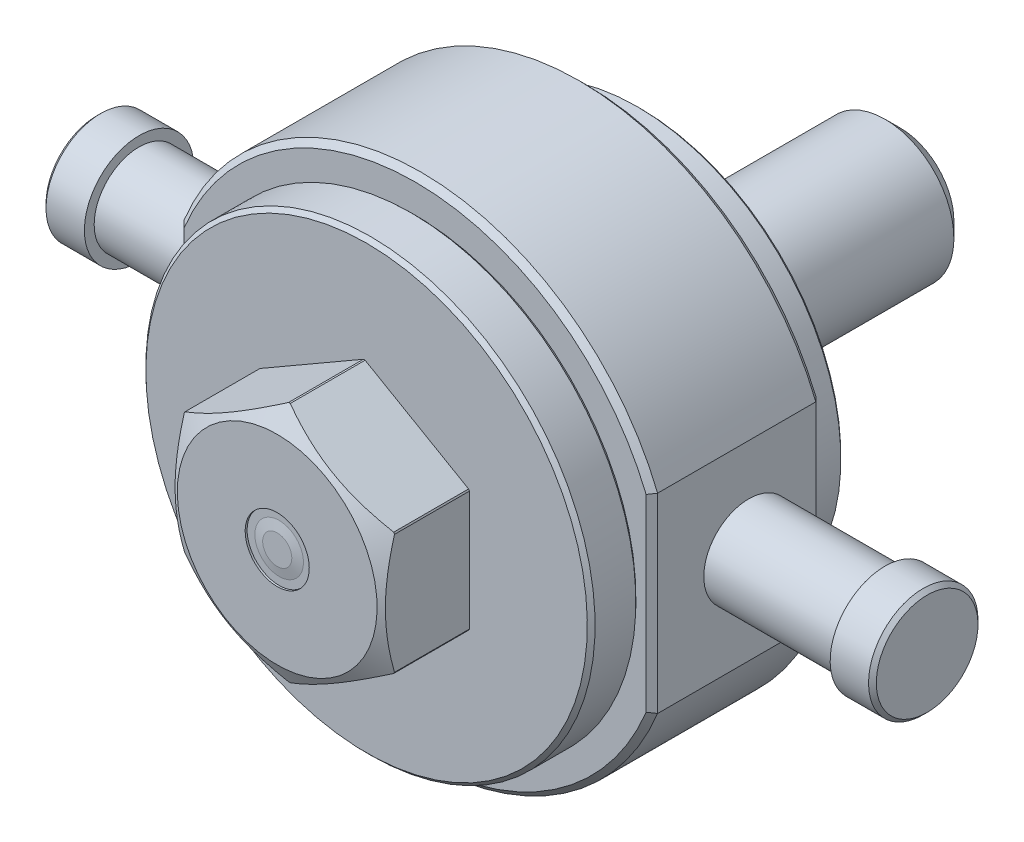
ISO-10303-21;
HEADER;
FILE_DESCRIPTION(('STEP AP214'),'2;1');
FILE_NAME('part.step','',(''),(''),'','','');
FILE_SCHEMA(('AUTOMOTIVE_DESIGN { 1 0 10303 214 1 1 1 1 }'));
ENDSEC;
DATA;
#1=APPLICATION_CONTEXT('core data for automotive mechanical design processes');
#2=APPLICATION_PROTOCOL_DEFINITION('international standard','automotive_design',2000,#1);
#3=PRODUCT_CONTEXT('',#1,'mechanical');
#4=PRODUCT('Part','Part','',(#3));
#5=PRODUCT_RELATED_PRODUCT_CATEGORY('part','',(#4));
#6=PRODUCT_DEFINITION_FORMATION('','',#4);
#7=PRODUCT_DEFINITION_CONTEXT('part definition',#1,'design');
#8=PRODUCT_DEFINITION('design','',#6,#7);
#9=PRODUCT_DEFINITION_SHAPE('','',#8);
#10=(LENGTH_UNIT() NAMED_UNIT(*) SI_UNIT(.MILLI.,.METRE.));
#11=(NAMED_UNIT(*) PLANE_ANGLE_UNIT() SI_UNIT($,.RADIAN.));
#12=(NAMED_UNIT(*) SI_UNIT($,.STERADIAN.) SOLID_ANGLE_UNIT());
#13=UNCERTAINTY_MEASURE_WITH_UNIT(LENGTH_MEASURE(1.E-05),#10,'distance_accuracy_value','');
#14=(GEOMETRIC_REPRESENTATION_CONTEXT(3) GLOBAL_UNCERTAINTY_ASSIGNED_CONTEXT((#13)) GLOBAL_UNIT_ASSIGNED_CONTEXT((#10,
#11,#12)) REPRESENTATION_CONTEXT('',''));
#15=CARTESIAN_POINT('',(0.,0.,0.));
#16=DIRECTION('',(0.,0.,1.));
#17=DIRECTION('',(1.,0.,0.));
#18=AXIS2_PLACEMENT_3D('',#15,#16,#17);
#19=CARTESIAN_POINT('',(-61.9,0.,95.0723030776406));
#20=DIRECTION('',(-1.,0.,0.));
#21=DIRECTION('',(0.,0.,1.));
#22=AXIS2_PLACEMENT_3D('',#19,#20,#21);
#23=PLANE('',#22);
#24=DIRECTION('',(0.,0.,-1.));
#25=VECTOR('',#24,1.);
#26=CARTESIAN_POINT('',(-61.9,-24.9482941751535,58.8772));
#27=LINE('',#26,#25);
#28=CARTESIAN_POINT('',(-61.9,-24.9482941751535,16.0034));
#29=VERTEX_POINT('',#28);
#30=CARTESIAN_POINT('',(-61.9,-24.9482941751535,57.3772));
#31=VERTEX_POINT('',#30);
#32=EDGE_CURVE('E187',#29,#31,#27,.F.);
#33=ORIENTED_EDGE('',*,*,#32,.T.);
#34=DIRECTION('',(0.,1.,0.));
#35=VECTOR('',#34,1.);
#36=CARTESIAN_POINT('',(-61.9,0.,57.3772));
#37=LINE('',#36,#35);
#38=CARTESIAN_POINT('',(-61.9,24.9482941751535,57.3772));
#39=VERTEX_POINT('',#38);
#40=EDGE_CURVE('E205',#31,#39,#37,.T.);
#41=ORIENTED_EDGE('',*,*,#40,.T.);
#42=DIRECTION('',(0.,0.,-1.));
#43=VECTOR('',#42,1.);
#44=CARTESIAN_POINT('',(-61.9,24.9482941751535,58.8772));
#45=LINE('',#44,#43);
#46=CARTESIAN_POINT('',(-61.9,24.9482941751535,16.0034));
#47=VERTEX_POINT('',#46);
#48=EDGE_CURVE('E261',#47,#39,#45,.F.);
#49=ORIENTED_EDGE('',*,*,#48,.F.);
#50=DIRECTION('',(0.,-1.,0.));
#51=VECTOR('',#50,1.);
#52=CARTESIAN_POINT('',(-61.9,-20.6022300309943,16.0034));
#53=LINE('',#52,#51);
#54=EDGE_CURVE('E202',#47,#29,#53,.T.);
#55=ORIENTED_EDGE('',*,*,#54,.T.);
#56=EDGE_LOOP('',(#33,#41,#49,#55));
#57=FACE_BOUND('',#56,.T.);
#58=CARTESIAN_POINT('',(-61.9,0.,33.5534));
#59=DIRECTION('',(-1.,0.,0.));
#60=DIRECTION('',(0.,0.,1.));
#61=AXIS2_PLACEMENT_3D('',#58,#59,#60);
#62=CIRCLE('',#61,11.75);
#63=CARTESIAN_POINT('',(-61.9,0.,45.3034));
#64=VERTEX_POINT('',#63);
#65=EDGE_CURVE('E368',#64,#64,#62,.F.);
#66=ORIENTED_EDGE('',*,*,#65,.T.);
#67=EDGE_LOOP('',(#66));
#68=FACE_BOUND('',#67,.T.);
#69=ADVANCED_FACE('F14',(#57,#68),#23,.T.);
#70=CARTESIAN_POINT('',(61.9,0.,95.0723030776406));
#71=DIRECTION('',(1.,0.,0.));
#72=DIRECTION('',(0.,0.,-1.));
#73=AXIS2_PLACEMENT_3D('',#70,#71,#72);
#74=PLANE('',#73);
#75=DIRECTION('',(0.,0.,-1.));
#76=VECTOR('',#75,1.);
#77=CARTESIAN_POINT('',(61.9,24.9482941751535,58.8772));
#78=LINE('',#77,#76);
#79=CARTESIAN_POINT('',(61.9,24.9482941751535,57.3772));
#80=VERTEX_POINT('',#79);
#81=CARTESIAN_POINT('',(61.9,24.9482941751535,16.0034));
#82=VERTEX_POINT('',#81);
#83=EDGE_CURVE('E171',#80,#82,#78,.T.);
#84=ORIENTED_EDGE('',*,*,#83,.F.);
#85=DIRECTION('',(0.,-1.,0.));
#86=VECTOR('',#85,1.);
#87=CARTESIAN_POINT('',(61.9,0.,57.3772));
#88=LINE('',#87,#86);
#89=CARTESIAN_POINT('',(61.9,-24.9482941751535,57.3772));
#90=VERTEX_POINT('',#89);
#91=EDGE_CURVE('E163',#80,#90,#88,.T.);
#92=ORIENTED_EDGE('',*,*,#91,.T.);
#93=DIRECTION('',(0.,0.,-1.));
#94=VECTOR('',#93,1.);
#95=CARTESIAN_POINT('',(61.9,-24.9482941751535,58.8772));
#96=LINE('',#95,#94);
#97=CARTESIAN_POINT('',(61.9,-24.9482941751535,16.0034));
#98=VERTEX_POINT('',#97);
#99=EDGE_CURVE('E168',#90,#98,#96,.T.);
#100=ORIENTED_EDGE('',*,*,#99,.T.);
#101=DIRECTION('',(0.,1.,0.));
#102=VECTOR('',#101,1.);
#103=CARTESIAN_POINT('',(61.9,20.6022300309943,16.0034));
#104=LINE('',#103,#102);
#105=EDGE_CURVE('E176',#98,#82,#104,.T.);
#106=ORIENTED_EDGE('',*,*,#105,.T.);
#107=EDGE_LOOP('',(#84,#92,#100,#106));
#108=FACE_BOUND('',#107,.T.);
#109=CARTESIAN_POINT('',(61.9,0.,33.5534));
#110=DIRECTION('',(1.,0.,0.));
#111=DIRECTION('',(0.,0.,-1.));
#112=AXIS2_PLACEMENT_3D('',#109,#110,#111);
#113=CIRCLE('',#112,11.75);
#114=CARTESIAN_POINT('',(61.9,0.,21.8034));
#115=VERTEX_POINT('',#114);
#116=EDGE_CURVE('E370',#115,#115,#113,.F.);
#117=ORIENTED_EDGE('',*,*,#116,.T.);
#118=EDGE_LOOP('',(#117));
#119=FACE_BOUND('',#118,.T.);
#120=ADVANCED_FACE('F165',(#108,#119),#74,.T.);
#121=CARTESIAN_POINT('',(130.744618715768,0.,33.5534));
#122=DIRECTION('',(-1.,0.,0.));
#123=DIRECTION('',(0.,-1.,0.));
#124=AXIS2_PLACEMENT_3D('',#121,#122,#123);
#125=CYLINDRICAL_SURFACE('',#124,11.75);
#126=ORIENTED_EDGE('',*,*,#116,.F.);
#127=EDGE_LOOP('',(#126));
#128=FACE_BOUND('',#127,.T.);
#129=CARTESIAN_POINT('',(97.5106,0.,33.5534));
#130=DIRECTION('',(-1.,0.,0.));
#131=DIRECTION('',(0.,-1.,0.));
#132=AXIS2_PLACEMENT_3D('',#129,#130,#131);
#133=CIRCLE('',#132,11.75);
#134=CARTESIAN_POINT('',(97.5106,-11.7499999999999,33.5534));
#135=VERTEX_POINT('',#134);
#136=EDGE_CURVE('E280',#135,#135,#133,.T.);
#137=ORIENTED_EDGE('',*,*,#136,.T.);
#138=EDGE_LOOP('',(#137));
#139=FACE_BOUND('',#138,.T.);
#140=ADVANCED_FACE('F363',(#128,#139),#125,.T.);
#141=CARTESIAN_POINT('',(0.,0.,58.8772));
#142=DIRECTION('',(0.,0.,1.));
#143=DIRECTION('',(0.,-1.,0.));
#144=AXIS2_PLACEMENT_3D('',#141,#142,#143);
#145=PLANE('',#144);
#146=CARTESIAN_POINT('',(0.,0.,58.8772));
#147=DIRECTION('',(0.,0.,1.));
#148=DIRECTION('',(1.,0.,0.));
#149=AXIS2_PLACEMENT_3D('',#146,#147,#148);
#150=CIRCLE('',#149,65.2385);
#151=CARTESIAN_POINT('',(-60.4,-24.6556663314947,58.8772));
#152=VERTEX_POINT('',#151);
#153=CARTESIAN_POINT('',(60.4,-24.6556663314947,58.8772));
#154=VERTEX_POINT('',#153);
#155=EDGE_CURVE('E276',#152,#154,#150,.T.);
#156=ORIENTED_EDGE('',*,*,#155,.T.);
#157=DIRECTION('',(0.,1.,0.));
#158=VECTOR('',#157,1.);
#159=CARTESIAN_POINT('',(60.4,0.,58.8772));
#160=LINE('',#159,#158);
#161=CARTESIAN_POINT('',(60.4,24.6556663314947,58.8772));
#162=VERTEX_POINT('',#161);
#163=EDGE_CURVE('E201',#154,#162,#160,.T.);
#164=ORIENTED_EDGE('',*,*,#163,.T.);
#165=CARTESIAN_POINT('',(-60.4,24.6556663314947,58.8772));
#166=VERTEX_POINT('',#165);
#167=EDGE_CURVE('E195',#162,#166,#150,.T.);
#168=ORIENTED_EDGE('',*,*,#167,.T.);
#169=DIRECTION('',(0.,-1.,0.));
#170=VECTOR('',#169,1.);
#171=CARTESIAN_POINT('',(-60.4,0.,58.8772));
#172=LINE('',#171,#170);
#173=EDGE_CURVE('E260',#166,#152,#172,.T.);
#174=ORIENTED_EDGE('',*,*,#173,.T.);
#175=EDGE_LOOP('',(#156,#164,#168,#174));
#176=FACE_BOUND('',#175,.T.);
#177=CARTESIAN_POINT('',(0.,0.,58.8772));
#178=DIRECTION('',(0.,0.,1.));
#179=DIRECTION('',(0.,-1.,0.));
#180=AXIS2_PLACEMENT_3D('',#177,#178,#179);
#181=CIRCLE('',#180,57.7215);
#182=CARTESIAN_POINT('',(0.,-57.7215,58.8772));
#183=VERTEX_POINT('',#182);
#184=EDGE_CURVE('E582',#183,#183,#181,.F.);
#185=ORIENTED_EDGE('',*,*,#184,.T.);
#186=EDGE_LOOP('',(#185));
#187=FACE_BOUND('',#186,.T.);
#188=ADVANCED_FACE('F226',(#176,#187),#145,.T.);
#189=CARTESIAN_POINT('',(0.,0.,57.3772));
#190=DIRECTION('',(0.,0.,-1.));
#191=DIRECTION('',(-1.,0.,0.));
#192=AXIS2_PLACEMENT_3D('',#189,#190,#191);
#193=CONICAL_SURFACE('',#192,66.7385,0.785398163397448);
#194=ORIENTED_EDGE('',*,*,#167,.F.);
#195=CARTESIAN_POINT('',(60.4,24.6556663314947,58.8772));
#196=CARTESIAN_POINT('',(60.6499724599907,24.7047199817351,58.6272275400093));
#197=CARTESIAN_POINT('',(60.8999586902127,24.7536324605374,58.3772413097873));
#198=CARTESIAN_POINT('',(61.3999586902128,24.8511750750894,57.8772413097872));
#199=CARTESIAN_POINT('',(61.6499724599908,24.89980521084,57.6272275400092));
#200=CARTESIAN_POINT('',(61.9,24.9482941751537,57.3772));
#201=B_SPLINE_CURVE_WITH_KNOTS('',3,(#195,#196,#197,#198,#199,#200),.UNSPECIFIED.,.F.,.F.,(4,2,
4),(0.,1.07070441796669,2.14140883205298),.UNSPECIFIED.);
#202=EDGE_CURVE('E244',#162,#80,#201,.T.);
#203=ORIENTED_EDGE('',*,*,#202,.T.);
#204=CARTESIAN_POINT('',(0.,0.,57.3772));
#205=DIRECTION('',(0.,0.,1.));
#206=DIRECTION('',(1.,0.,0.));
#207=AXIS2_PLACEMENT_3D('',#204,#205,#206);
#208=CIRCLE('',#207,66.7385);
#209=EDGE_CURVE('E196',#80,#39,#208,.T.);
#210=ORIENTED_EDGE('',*,*,#209,.T.);
#211=CARTESIAN_POINT('',(-61.9,24.9482941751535,57.3772));
#212=CARTESIAN_POINT('',(-61.6499724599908,24.8998052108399,57.6272275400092));
#213=CARTESIAN_POINT('',(-61.3999586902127,24.8511750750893,57.8772413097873));
#214=CARTESIAN_POINT('',(-60.8999586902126,24.7536324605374,58.3772413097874));
#215=CARTESIAN_POINT('',(-60.6499724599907,24.7047199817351,58.6272275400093));
#216=CARTESIAN_POINT('',(-60.4,24.6556663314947,58.8772));
#217=B_SPLINE_CURVE_WITH_KNOTS('',3,(#211,#212,#213,#214,#215,#216),.UNSPECIFIED.,.F.,.F.,(4,2,
4),(0.,1.07070441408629,2.14140883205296),.UNSPECIFIED.);
#218=EDGE_CURVE('E237',#39,#166,#217,.T.);
#219=ORIENTED_EDGE('',*,*,#218,.T.);
#220=EDGE_LOOP('',(#194,#203,#210,#219));
#221=FACE_BOUND('',#220,.T.);
#222=ADVANCED_FACE('F222',(#221),#193,.T.);
#223=EDGE_CURVE('E183',#31,#90,#208,.T.);
#224=ORIENTED_EDGE('',*,*,#223,.T.);
#225=CARTESIAN_POINT('',(61.9,-24.9482941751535,57.3772));
#226=CARTESIAN_POINT('',(61.6499724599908,-24.8998052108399,57.6272275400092));
#227=CARTESIAN_POINT('',(61.3999586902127,-24.8511750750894,57.8772413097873));
#228=CARTESIAN_POINT('',(60.8999586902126,-24.7536324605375,58.3772413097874));
#229=CARTESIAN_POINT('',(60.6499724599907,-24.7047199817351,58.6272275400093));
#230=CARTESIAN_POINT('',(60.4,-24.6556663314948,58.8772));
#231=B_SPLINE_CURVE_WITH_KNOTS('',3,(#225,#226,#227,#228,#229,#230),.UNSPECIFIED.,.F.,.F.,(4,2,
4),(0.,1.07070441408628,2.14140883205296),.UNSPECIFIED.);
#232=EDGE_CURVE('E192',#90,#154,#231,.T.);
#233=ORIENTED_EDGE('',*,*,#232,.T.);
#234=ORIENTED_EDGE('',*,*,#155,.F.);
#235=CARTESIAN_POINT('',(-60.4,-24.6556663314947,58.8772));
#236=CARTESIAN_POINT('',(-60.6499724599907,-24.7047199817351,58.6272275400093));
#237=CARTESIAN_POINT('',(-60.8999586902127,-24.7536324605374,58.3772413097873));
#238=CARTESIAN_POINT('',(-61.3999586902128,-24.8511750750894,57.8772413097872));
#239=CARTESIAN_POINT('',(-61.6499724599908,-24.89980521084,57.6272275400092));
#240=CARTESIAN_POINT('',(-61.9,-24.9482941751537,57.3772));
#241=B_SPLINE_CURVE_WITH_KNOTS('',3,(#235,#236,#237,#238,#239,#240),.UNSPECIFIED.,.F.,.F.,(4,2,
4),(0.,1.07070441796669,2.14140883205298),.UNSPECIFIED.);
#242=EDGE_CURVE('E175',#152,#31,#241,.T.);
#243=ORIENTED_EDGE('',*,*,#242,.T.);
#244=EDGE_LOOP('',(#224,#233,#234,#243));
#245=FACE_BOUND('',#244,.T.);
#246=ADVANCED_FACE('F190',(#245),#193,.T.);
#247=CARTESIAN_POINT('',(0.,0.,14.5034));
#248=DIRECTION('',(0.,0.,1.));
#249=DIRECTION('',(1.,0.,0.));
#250=AXIS2_PLACEMENT_3D('',#247,#248,#249);
#251=CONICAL_SURFACE('',#250,65.2385,0.785398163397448);
#252=CARTESIAN_POINT('',(0.,0.,16.0034));
#253=DIRECTION('',(0.,0.,1.));
#254=DIRECTION('',(1.,0.,0.));
#255=AXIS2_PLACEMENT_3D('',#252,#253,#254);
#256=CIRCLE('',#255,66.7385);
#257=EDGE_CURVE('E257',#82,#47,#256,.T.);
#258=ORIENTED_EDGE('',*,*,#257,.F.);
#259=CARTESIAN_POINT('',(61.9,24.9482941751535,16.0034));
#260=CARTESIAN_POINT('',(61.6499724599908,24.89980521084,15.7533724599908));
#261=CARTESIAN_POINT('',(61.3999586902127,24.8511750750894,15.5033586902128));
#262=CARTESIAN_POINT('',(60.8999586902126,24.7536324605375,15.0033586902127));
#263=CARTESIAN_POINT('',(60.6499724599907,24.7047199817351,14.7533724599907));
#264=CARTESIAN_POINT('',(60.4,24.6556663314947,14.5034));
#265=B_SPLINE_CURVE_WITH_KNOTS('',3,(#259,#260,#261,#262,#263,#264),.UNSPECIFIED.,.F.,.F.,(4,2,
4),(0.,1.07070441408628,2.14140883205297),.UNSPECIFIED.);
#266=CARTESIAN_POINT('',(60.4,24.6556663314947,14.5034));
#267=VERTEX_POINT('',#266);
#268=EDGE_CURVE('E265',#82,#267,#265,.T.);
#269=ORIENTED_EDGE('',*,*,#268,.T.);
#270=CARTESIAN_POINT('',(0.,0.,14.5034));
#271=DIRECTION('',(0.,0.,1.));
#272=DIRECTION('',(1.,0.,0.));
#273=AXIS2_PLACEMENT_3D('',#270,#271,#272);
#274=CIRCLE('',#273,65.2385);
#275=CARTESIAN_POINT('',(-60.4,24.6556663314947,14.5034));
#276=VERTEX_POINT('',#275);
#277=EDGE_CURVE('E270',#267,#276,#274,.T.);
#278=ORIENTED_EDGE('',*,*,#277,.T.);
#279=CARTESIAN_POINT('',(-60.4,24.6556663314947,14.5034));
#280=CARTESIAN_POINT('',(-60.6499724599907,24.7047199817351,14.7533724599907));
#281=CARTESIAN_POINT('',(-60.8999586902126,24.7536324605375,15.0033586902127));
#282=CARTESIAN_POINT('',(-61.3999586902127,24.8511750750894,15.5033586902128));
#283=CARTESIAN_POINT('',(-61.6499724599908,24.89980521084,15.7533724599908));
#284=CARTESIAN_POINT('',(-61.9,24.9482941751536,16.0034));
#285=B_SPLINE_CURVE_WITH_KNOTS('',3,(#279,#280,#281,#282,#283,#284),.UNSPECIFIED.,.F.,.F.,(4,2,
4),(0.,1.07070441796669,2.14140883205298),.UNSPECIFIED.);
#286=EDGE_CURVE('E267',#276,#47,#285,.T.);
#287=ORIENTED_EDGE('',*,*,#286,.T.);
#288=EDGE_LOOP('',(#258,#269,#278,#287));
#289=FACE_BOUND('',#288,.T.);
#290=ADVANCED_FACE('F228',(#289),#251,.T.);
#291=CARTESIAN_POINT('',(-60.4,-24.6556663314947,14.5034));
#292=VERTEX_POINT('',#291);
#293=CARTESIAN_POINT('',(60.4,-24.6556663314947,14.5034));
#294=VERTEX_POINT('',#293);
#295=EDGE_CURVE('E268',#292,#294,#274,.T.);
#296=ORIENTED_EDGE('',*,*,#295,.T.);
#297=CARTESIAN_POINT('',(60.4,-24.6556663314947,14.5034));
#298=CARTESIAN_POINT('',(60.6499724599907,-24.7047199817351,14.7533724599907));
#299=CARTESIAN_POINT('',(60.8999586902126,-24.7536324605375,15.0033586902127));
#300=CARTESIAN_POINT('',(61.3999586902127,-24.8511750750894,15.5033586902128));
#301=CARTESIAN_POINT('',(61.6499724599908,-24.89980521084,15.7533724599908));
#302=CARTESIAN_POINT('',(61.9,-24.9482941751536,16.0034));
#303=B_SPLINE_CURVE_WITH_KNOTS('',3,(#297,#298,#299,#300,#301,#302),.UNSPECIFIED.,.F.,.F.,(4,2,
4),(0.,1.07070441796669,2.14140883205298),.UNSPECIFIED.);
#304=EDGE_CURVE('E9',#294,#98,#303,.T.);
#305=ORIENTED_EDGE('',*,*,#304,.T.);
#306=EDGE_CURVE('E185',#29,#98,#256,.T.);
#307=ORIENTED_EDGE('',*,*,#306,.F.);
#308=CARTESIAN_POINT('',(-61.9,-24.9482941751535,16.0034));
#309=CARTESIAN_POINT('',(-61.6499724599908,-24.89980521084,15.7533724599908));
#310=CARTESIAN_POINT('',(-61.3999586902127,-24.8511750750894,15.5033586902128));
#311=CARTESIAN_POINT('',(-60.8999586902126,-24.7536324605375,15.0033586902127));
#312=CARTESIAN_POINT('',(-60.6499724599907,-24.7047199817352,14.7533724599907));
#313=CARTESIAN_POINT('',(-60.4,-24.6556663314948,14.5034));
#314=B_SPLINE_CURVE_WITH_KNOTS('',3,(#308,#309,#310,#311,#312,#313),.UNSPECIFIED.,.F.,.F.,(4,2,
4),(0.,1.07070441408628,2.14140883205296),.UNSPECIFIED.);
#315=EDGE_CURVE('E28',#29,#292,#314,.T.);
#316=ORIENTED_EDGE('',*,*,#315,.T.);
#317=EDGE_LOOP('',(#296,#305,#307,#316));
#318=FACE_BOUND('',#317,.T.);
#319=ADVANCED_FACE('F908',(#318),#251,.T.);
#320=CARTESIAN_POINT('',(0.,0.,14.5034));
#321=DIRECTION('',(0.,0.,1.));
#322=DIRECTION('',(0.,-1.,0.));
#323=AXIS2_PLACEMENT_3D('',#320,#321,#322);
#324=PLANE('',#323);
#325=CARTESIAN_POINT('',(0.,0.,14.5034));
#326=DIRECTION('',(0.,0.,-1.));
#327=DIRECTION('',(0.,1.,0.));
#328=AXIS2_PLACEMENT_3D('',#325,#326,#327);
#329=CIRCLE('',#328,31.7545429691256);
#330=CARTESIAN_POINT('',(0.,31.7545429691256,14.5034));
#331=VERTEX_POINT('',#330);
#332=EDGE_CURVE('E322',#331,#331,#329,.T.);
#333=ORIENTED_EDGE('',*,*,#332,.F.);
#334=EDGE_LOOP('',(#333));
#335=FACE_BOUND('',#334,.T.);
#336=ORIENTED_EDGE('',*,*,#277,.F.);
#337=DIRECTION('',(0.,-1.,0.));
#338=VECTOR('',#337,1.);
#339=CARTESIAN_POINT('',(60.4,-20.6022300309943,14.5034));
#340=LINE('',#339,#338);
#341=EDGE_CURVE('E35',#267,#294,#340,.T.);
#342=ORIENTED_EDGE('',*,*,#341,.T.);
#343=ORIENTED_EDGE('',*,*,#295,.F.);
#344=DIRECTION('',(0.,1.,0.));
#345=VECTOR('',#344,1.);
#346=CARTESIAN_POINT('',(-60.4,20.6022300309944,14.5034));
#347=LINE('',#346,#345);
#348=EDGE_CURVE('E346',#292,#276,#347,.T.);
#349=ORIENTED_EDGE('',*,*,#348,.T.);
#350=EDGE_LOOP('',(#336,#342,#343,#349));
#351=FACE_BOUND('',#350,.T.);
#352=ADVANCED_FACE('F298',(#335,#351),#324,.F.);
#353=CARTESIAN_POINT('',(0.,0.,58.8772));
#354=DIRECTION('',(0.,0.,-1.));
#355=DIRECTION('',(0.,1.,0.));
#356=AXIS2_PLACEMENT_3D('',#353,#354,#355);
#357=CYLINDRICAL_SURFACE('',#356,66.7385);
#358=ORIENTED_EDGE('',*,*,#209,.F.);
#359=ORIENTED_EDGE('',*,*,#83,.T.);
#360=ORIENTED_EDGE('',*,*,#257,.T.);
#361=ORIENTED_EDGE('',*,*,#48,.T.);
#362=EDGE_LOOP('',(#358,#359,#360,#361));
#363=FACE_BOUND('',#362,.T.);
#364=ADVANCED_FACE('F255',(#363),#357,.T.);
#365=ORIENTED_EDGE('',*,*,#99,.F.);
#366=ORIENTED_EDGE('',*,*,#223,.F.);
#367=ORIENTED_EDGE('',*,*,#32,.F.);
#368=ORIENTED_EDGE('',*,*,#306,.T.);
#369=EDGE_LOOP('',(#365,#366,#367,#368));
#370=FACE_BOUND('',#369,.T.);
#371=ADVANCED_FACE('F181',(#370),#357,.T.);
#372=CARTESIAN_POINT('',(-97.5106,0.,33.5534));
#373=DIRECTION('',(1.,0.,0.));
#374=DIRECTION('',(0.,1.,0.));
#375=AXIS2_PLACEMENT_3D('',#372,#373,#374);
#376=CIRCLE('',#375,11.75);
#377=CARTESIAN_POINT('',(-97.5106,11.75,33.5534));
#378=VERTEX_POINT('',#377);
#379=EDGE_CURVE('E283',#378,#378,#376,.T.);
#380=ORIENTED_EDGE('',*,*,#379,.T.);
#381=EDGE_LOOP('',(#380));
#382=FACE_BOUND('',#381,.T.);
#383=ORIENTED_EDGE('',*,*,#65,.F.);
#384=EDGE_LOOP('',(#383));
#385=FACE_BOUND('',#384,.T.);
#386=ADVANCED_FACE('F378',(#382,#385),#125,.T.);
#387=CARTESIAN_POINT('',(26.1239,0.,94.9452));
#388=DIRECTION('',(0.,0.,-1.));
#389=DIRECTION('',(1.,0.,0.));
#390=AXIS2_PLACEMENT_3D('',#387,#388,#389);
#391=PLANE('',#390);
#392=CARTESIAN_POINT('',(0.,0.,94.9452000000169));
#393=DIRECTION('',(0.,0.,-1.));
#394=DIRECTION('',(0.,1.,0.));
#395=AXIS2_PLACEMENT_3D('',#392,#393,#394);
#396=CIRCLE('',#395,3.80999999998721);
#397=CARTESIAN_POINT('',(0.,3.80999999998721,94.9452000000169));
#398=VERTEX_POINT('',#397);
#399=EDGE_CURVE('E286',#398,#398,#396,.T.);
#400=ORIENTED_EDGE('',*,*,#399,.F.);
#401=EDGE_LOOP('',(#400));
#402=FACE_BOUND('',#401,.T.);
#403=ADVANCED_FACE('F431',(#402),#391,.F.);
#404=CARTESIAN_POINT('',(0.,0.,94.4372000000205));
#405=DIRECTION('',(0.,0.,-1.));
#406=DIRECTION('',(0.,1.,0.));
#407=AXIS2_PLACEMENT_3D('',#404,#405,#406);
#408=CONICAL_SURFACE('',#407,6.34999999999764,1.37340076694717);
#409=ORIENTED_EDGE('',*,*,#399,.T.);
#410=EDGE_LOOP('',(#409));
#411=FACE_BOUND('',#410,.T.);
#412=CARTESIAN_POINT('',(0.,0.,94.4372000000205));
#413=DIRECTION('',(0.,0.,-1.));
#414=DIRECTION('',(0.,1.,0.));
#415=AXIS2_PLACEMENT_3D('',#412,#413,#414);
#416=CIRCLE('',#415,6.34999999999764);
#417=CARTESIAN_POINT('',(0.,6.34999999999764,94.4372000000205));
#418=VERTEX_POINT('',#417);
#419=EDGE_CURVE('E666',#418,#418,#416,.F.);
#420=ORIENTED_EDGE('',*,*,#419,.T.);
#421=EDGE_LOOP('',(#420));
#422=FACE_BOUND('',#421,.T.);
#423=ADVANCED_FACE('F671',(#411,#422),#408,.T.);
#424=CARTESIAN_POINT('',(0.,-6.35,94.4372));
#425=DIRECTION('',(0.,0.,-1.));
#426=DIRECTION('',(0.,1.,0.));
#427=AXIS2_PLACEMENT_3D('',#424,#425,#426);
#428=PLANE('',#427);
#429=CARTESIAN_POINT('',(0.,0.,94.4372));
#430=DIRECTION('',(0.,0.,1.));
#431=DIRECTION('',(0.,-1.,0.));
#432=AXIS2_PLACEMENT_3D('',#429,#430,#431);
#433=CIRCLE('',#432,8.382);
#434=CARTESIAN_POINT('',(0.,-8.382,94.4372));
#435=VERTEX_POINT('',#434);
#436=EDGE_CURVE('E660',#435,#435,#433,.T.);
#437=ORIENTED_EDGE('',*,*,#436,.T.);
#438=EDGE_LOOP('',(#437));
#439=FACE_BOUND('',#438,.T.);
#440=ORIENTED_EDGE('',*,*,#419,.F.);
#441=EDGE_LOOP('',(#440));
#442=FACE_BOUND('',#441,.T.);
#443=ADVANCED_FACE('F680',(#439,#442),#428,.F.);
#444=CARTESIAN_POINT('',(0.,0.,102.300292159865));
#445=DIRECTION('',(0.,0.,1.));
#446=DIRECTION('',(0.,-1.,0.));
#447=AXIS2_PLACEMENT_3D('',#444,#445,#446);
#448=CYLINDRICAL_SURFACE('',#447,8.382);
#449=ORIENTED_EDGE('',*,*,#436,.F.);
#450=EDGE_LOOP('',(#449));
#451=FACE_BOUND('',#450,.T.);
#452=CARTESIAN_POINT('',(0.,0.,94.9452));
#453=DIRECTION('',(0.,0.,1.));
#454=DIRECTION('',(0.,-1.,0.));
#455=AXIS2_PLACEMENT_3D('',#452,#453,#454);
#456=CIRCLE('',#455,8.382);
#457=CARTESIAN_POINT('',(0.,-8.382,94.9452));
#458=VERTEX_POINT('',#457);
#459=EDGE_CURVE('E656',#458,#458,#456,.T.);
#460=ORIENTED_EDGE('',*,*,#459,.T.);
#461=EDGE_LOOP('',(#460));
#462=FACE_BOUND('',#461,.T.);
#463=ADVANCED_FACE('F822',(#451,#462),#448,.F.);
#464=CARTESIAN_POINT('',(26.1239,0.,94.9452));
#465=DIRECTION('',(0.,0.,-1.));
#466=DIRECTION('',(1.,0.,0.));
#467=AXIS2_PLACEMENT_3D('',#464,#465,#466);
#468=PLANE('',#467);
#469=ORIENTED_EDGE('',*,*,#459,.F.);
#470=EDGE_LOOP('',(#469));
#471=FACE_BOUND('',#470,.T.);
#472=CARTESIAN_POINT('',(0.,0.,94.9452));
#473=DIRECTION('',(0.,0.,-1.));
#474=DIRECTION('',(0.,1.,0.));
#475=AXIS2_PLACEMENT_3D('',#472,#473,#474);
#476=CIRCLE('',#475,26.1239);
#477=CARTESIAN_POINT('',(0.,26.1239,94.9452));
#478=VERTEX_POINT('',#477);
#479=EDGE_CURVE('E571',#478,#478,#476,.T.);
#480=ORIENTED_EDGE('',*,*,#479,.F.);
#481=EDGE_LOOP('',(#480));
#482=FACE_BOUND('',#481,.T.);
#483=ADVANCED_FACE('F817',(#471,#482),#468,.F.);
#484=CARTESIAN_POINT('',(0.,0.,244.882809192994));
#485=DIRECTION('',(0.,0.,1.));
#486=DIRECTION('',(-1.,0.,0.));
#487=AXIS2_PLACEMENT_3D('',#484,#485,#486);
#488=CYLINDRICAL_SURFACE('',#487,31.623);
#489=DIRECTION('',(0.,0.,1.));
#490=VECTOR('',#489,1.);
#491=CARTESIAN_POINT('',(-27.275821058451,16.001366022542,-68.3768));
#492=LINE('',#491,#490);
#493=CARTESIAN_POINT('',(-27.275821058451,16.001366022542,72.1868));
#494=VERTEX_POINT('',#493);
#495=CARTESIAN_POINT('',(-27.275821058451,16.001366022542,91.7702931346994));
#496=VERTEX_POINT('',#495);
#497=EDGE_CURVE('E534',#494,#496,#492,.T.);
#498=ORIENTED_EDGE('',*,*,#497,.F.);
#499=CARTESIAN_POINT('',(0.,0.,72.1868));
#500=DIRECTION('',(0.,0.,1.));
#501=DIRECTION('',(-1.,0.,0.));
#502=AXIS2_PLACEMENT_3D('',#499,#500,#501);
#503=CIRCLE('',#502,31.623);
#504=CARTESIAN_POINT('',(-27.4955,15.6208709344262,72.1868));
#505=VERTEX_POINT('',#504);
#506=EDGE_CURVE('E654',#494,#505,#503,.T.);
#507=ORIENTED_EDGE('',*,*,#506,.T.);
#508=DIRECTION('',(0.,0.,1.));
#509=VECTOR('',#508,1.);
#510=CARTESIAN_POINT('',(-27.4955,15.6208709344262,-68.3768));
#511=LINE('',#510,#509);
#512=CARTESIAN_POINT('',(-27.4955,15.6208709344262,91.7702931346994));
#513=VERTEX_POINT('',#512);
#514=EDGE_CURVE('E643',#513,#505,#511,.F.);
#515=ORIENTED_EDGE('',*,*,#514,.F.);
#516=CARTESIAN_POINT('',(0.,0.,91.7702931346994));
#517=DIRECTION('',(0.,0.,-1.));
#518=DIRECTION('',(1.,0.,0.));
#519=AXIS2_PLACEMENT_3D('',#516,#517,#518);
#520=CIRCLE('',#519,31.623);
#521=EDGE_CURVE('E549',#496,#513,#520,.F.);
#522=ORIENTED_EDGE('',*,*,#521,.F.);
#523=EDGE_LOOP('',(#498,#507,#515,#522));
#524=FACE_BOUND('',#523,.T.);
#525=ADVANCED_FACE('F653',(#524),#488,.T.);
#526=CARTESIAN_POINT('',(0.,0.,244.882809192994));
#527=DIRECTION('',(0.,0.,1.));
#528=DIRECTION('',(-1.,0.,0.));
#529=AXIS2_PLACEMENT_3D('',#526,#527,#528);
#530=CYLINDRICAL_SURFACE('',#529,31.623);
#531=DIRECTION('',(0.,0.,1.));
#532=VECTOR('',#531,1.);
#533=CARTESIAN_POINT('',(-27.4955,-15.6208709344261,-68.3768));
#534=LINE('',#533,#532);
#535=CARTESIAN_POINT('',(-27.4955,-15.6208709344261,72.1868));
#536=VERTEX_POINT('',#535);
#537=CARTESIAN_POINT('',(-27.4955,-15.6208709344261,91.7702931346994));
#538=VERTEX_POINT('',#537);
#539=EDGE_CURVE('E496',#536,#538,#534,.T.);
#540=ORIENTED_EDGE('',*,*,#539,.F.);
#541=CARTESIAN_POINT('',(0.,0.,72.1868));
#542=DIRECTION('',(0.,0.,1.));
#543=DIRECTION('',(-1.,0.,0.));
#544=AXIS2_PLACEMENT_3D('',#541,#542,#543);
#545=CIRCLE('',#544,31.623);
#546=CARTESIAN_POINT('',(-27.275821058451,-16.001366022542,72.1868));
#547=VERTEX_POINT('',#546);
#548=EDGE_CURVE('E655',#536,#547,#545,.T.);
#549=ORIENTED_EDGE('',*,*,#548,.T.);
#550=DIRECTION('',(0.,0.,1.));
#551=VECTOR('',#550,1.);
#552=CARTESIAN_POINT('',(-27.275821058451,-16.001366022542,-68.3768));
#553=LINE('',#552,#551);
#554=CARTESIAN_POINT('',(-27.275821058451,-16.001366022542,91.7702931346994));
#555=VERTEX_POINT('',#554);
#556=EDGE_CURVE('E495',#555,#547,#553,.F.);
#557=ORIENTED_EDGE('',*,*,#556,.F.);
#558=CARTESIAN_POINT('',(0.,0.,91.7702931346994));
#559=DIRECTION('',(0.,0.,-1.));
#560=DIRECTION('',(1.,0.,0.));
#561=AXIS2_PLACEMENT_3D('',#558,#559,#560);
#562=CIRCLE('',#561,31.623);
#563=EDGE_CURVE('E561',#538,#555,#562,.F.);
#564=ORIENTED_EDGE('',*,*,#563,.F.);
#565=EDGE_LOOP('',(#540,#549,#557,#564));
#566=FACE_BOUND('',#565,.T.);
#567=ADVANCED_FACE('F858',(#566),#530,.T.);
#568=CARTESIAN_POINT('',(0.,0.,244.882809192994));
#569=DIRECTION('',(0.,0.,1.));
#570=DIRECTION('',(-1.,0.,0.));
#571=AXIS2_PLACEMENT_3D('',#568,#569,#570);
#572=CYLINDRICAL_SURFACE('',#571,31.623);
#573=DIRECTION('',(0.,0.,1.));
#574=VECTOR('',#573,1.);
#575=CARTESIAN_POINT('',(-0.21967894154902,-31.6222369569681,-68.3768));
#576=LINE('',#575,#574);
#577=CARTESIAN_POINT('',(-0.219678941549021,-31.6222369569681,72.1868));
#578=VERTEX_POINT('',#577);
#579=CARTESIAN_POINT('',(-0.219678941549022,-31.6222369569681,91.7702931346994));
#580=VERTEX_POINT('',#579);
#581=EDGE_CURVE('E637',#578,#580,#576,.T.);
#582=ORIENTED_EDGE('',*,*,#581,.F.);
#583=CARTESIAN_POINT('',(0.,0.,72.1868));
#584=DIRECTION('',(0.,0.,1.));
#585=DIRECTION('',(-1.,0.,0.));
#586=AXIS2_PLACEMENT_3D('',#583,#584,#585);
#587=CIRCLE('',#586,31.623);
#588=CARTESIAN_POINT('',(0.219678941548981,-31.6222369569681,72.1868));
#589=VERTEX_POINT('',#588);
#590=EDGE_CURVE('E566',#578,#589,#587,.T.);
#591=ORIENTED_EDGE('',*,*,#590,.T.);
#592=DIRECTION('',(0.,0.,1.));
#593=VECTOR('',#592,1.);
#594=CARTESIAN_POINT('',(0.219678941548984,-31.6222369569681,-68.3768));
#595=LINE('',#594,#593);
#596=CARTESIAN_POINT('',(0.21967894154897,-31.6222369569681,91.7702931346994));
#597=VERTEX_POINT('',#596);
#598=EDGE_CURVE('E634',#597,#589,#595,.F.);
#599=ORIENTED_EDGE('',*,*,#598,.F.);
#600=CARTESIAN_POINT('',(0.,0.,91.7702931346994));
#601=DIRECTION('',(0.,0.,-1.));
#602=DIRECTION('',(1.,0.,0.));
#603=AXIS2_PLACEMENT_3D('',#600,#601,#602);
#604=CIRCLE('',#603,31.623);
#605=EDGE_CURVE('E556',#580,#597,#604,.F.);
#606=ORIENTED_EDGE('',*,*,#605,.F.);
#607=EDGE_LOOP('',(#582,#591,#599,#606));
#608=FACE_BOUND('',#607,.T.);
#609=ADVANCED_FACE('F849',(#608),#572,.T.);
#610=CARTESIAN_POINT('',(0.,0.,244.882809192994));
#611=DIRECTION('',(0.,0.,1.));
#612=DIRECTION('',(-1.,0.,0.));
#613=AXIS2_PLACEMENT_3D('',#610,#611,#612);
#614=CYLINDRICAL_SURFACE('',#613,31.623);
#615=DIRECTION('',(0.,0.,1.));
#616=VECTOR('',#615,1.);
#617=CARTESIAN_POINT('',(27.275821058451,-16.001366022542,-68.3768));
#618=LINE('',#617,#616);
#619=CARTESIAN_POINT('',(27.275821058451,-16.001366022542,72.1868));
#620=VERTEX_POINT('',#619);
#621=CARTESIAN_POINT('',(27.275821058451,-16.001366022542,91.7702931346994));
#622=VERTEX_POINT('',#621);
#623=EDGE_CURVE('E631',#620,#622,#618,.T.);
#624=ORIENTED_EDGE('',*,*,#623,.F.);
#625=CARTESIAN_POINT('',(0.,0.,72.1868));
#626=DIRECTION('',(0.,0.,1.));
#627=DIRECTION('',(-1.,0.,0.));
#628=AXIS2_PLACEMENT_3D('',#625,#626,#627);
#629=CIRCLE('',#628,31.623);
#630=CARTESIAN_POINT('',(27.4955,-15.6208709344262,72.1868));
#631=VERTEX_POINT('',#630);
#632=EDGE_CURVE('E555',#620,#631,#629,.T.);
#633=ORIENTED_EDGE('',*,*,#632,.T.);
#634=DIRECTION('',(0.,0.,1.));
#635=VECTOR('',#634,1.);
#636=CARTESIAN_POINT('',(27.4955,-15.6208709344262,-68.3768));
#637=LINE('',#636,#635);
#638=CARTESIAN_POINT('',(27.4955,-15.6208709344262,91.7702931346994));
#639=VERTEX_POINT('',#638);
#640=EDGE_CURVE('E628',#639,#631,#637,.F.);
#641=ORIENTED_EDGE('',*,*,#640,.F.);
#642=CARTESIAN_POINT('',(0.,0.,91.7702931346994));
#643=DIRECTION('',(0.,0.,1.));
#644=DIRECTION('',(-1.,0.,0.));
#645=AXIS2_PLACEMENT_3D('',#642,#643,#644);
#646=CIRCLE('',#645,31.623);
#647=EDGE_CURVE('E553',#639,#622,#646,.F.);
#648=ORIENTED_EDGE('',*,*,#647,.T.);
#649=EDGE_LOOP('',(#624,#633,#641,#648));
#650=FACE_BOUND('',#649,.T.);
#651=ADVANCED_FACE('F464',(#650),#614,.T.);
#652=CARTESIAN_POINT('',(0.,0.,91.7702931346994));
#653=DIRECTION('',(0.,0.,-1.));
#654=DIRECTION('',(0.,1.,0.));
#655=AXIS2_PLACEMENT_3D('',#652,#653,#654);
#656=CONICAL_SURFACE('',#655,31.623,1.0471975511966);
#657=ORIENTED_EDGE('',*,*,#479,.T.);
#658=EDGE_LOOP('',(#657));
#659=FACE_BOUND('',#658,.T.);
#660=ORIENTED_EDGE('',*,*,#521,.T.);
#661=CARTESIAN_POINT('',(-27.4955,-15.6208709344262,91.7702931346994));
#662=CARTESIAN_POINT('',(-27.4955,-14.9793557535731,91.953238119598));
#663=CARTESIAN_POINT('',(-27.4955,-14.3355447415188,92.1283419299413));
#664=CARTESIAN_POINT('',(-27.4955,-13.0432151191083,92.4608925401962));
#665=CARTESIAN_POINT('',(-27.4955,-12.3946953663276,92.6183348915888));
#666=CARTESIAN_POINT('',(-27.4955,-11.0918276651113,92.9137949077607));
#667=CARTESIAN_POINT('',(-27.4955,-10.4374705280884,93.0517723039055));
#668=CARTESIAN_POINT('',(-27.4955,-9.12452792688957,93.3058287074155));
#669=CARTESIAN_POINT('',(-27.4955,-8.46594265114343,93.4219086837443));
#670=CARTESIAN_POINT('',(-27.4955,-7.15990008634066,93.6278296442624));
#671=CARTESIAN_POINT('',(-27.4955,-6.51252730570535,93.7182039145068));
#672=CARTESIAN_POINT('',(-27.4955,-5.21480773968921,93.8744704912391));
#673=CARTESIAN_POINT('',(-27.4955,-4.56446092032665,93.9403625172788));
#674=CARTESIAN_POINT('',(-27.4955,-3.26230667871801,94.0462872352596));
#675=CARTESIAN_POINT('',(-27.4955,-2.610501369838,94.086345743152));
#676=CARTESIAN_POINT('',(-27.4955,-1.30579736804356,94.1398552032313));
#677=CARTESIAN_POINT('',(-27.4955,-0.652898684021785,94.1533063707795));
#678=CARTESIAN_POINT('',(-27.4955,0.652898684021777,94.1533063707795));
#679=CARTESIAN_POINT('',(-27.4955,1.30579736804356,94.1398552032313));
#680=CARTESIAN_POINT('',(-27.4955,2.61050136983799,94.086345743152));
#681=CARTESIAN_POINT('',(-27.4955,3.262306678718,94.0462872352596));
#682=CARTESIAN_POINT('',(-27.4955,4.56446092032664,93.9403625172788));
#683=CARTESIAN_POINT('',(-27.4955,5.2148077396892,93.8744704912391));
#684=CARTESIAN_POINT('',(-27.4955,6.51252730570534,93.7182039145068));
#685=CARTESIAN_POINT('',(-27.4955,7.15990008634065,93.6278296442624));
#686=CARTESIAN_POINT('',(-27.4955,8.46594265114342,93.4219086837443));
#687=CARTESIAN_POINT('',(-27.4955,9.12452792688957,93.3058287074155));
#688=CARTESIAN_POINT('',(-27.4955,10.4374705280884,93.0517723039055));
#689=CARTESIAN_POINT('',(-27.4955,11.0918276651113,92.9137949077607));
#690=CARTESIAN_POINT('',(-27.4955,12.3946953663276,92.6183348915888));
#691=CARTESIAN_POINT('',(-27.4955,13.0432151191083,92.4608925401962));
#692=CARTESIAN_POINT('',(-27.4955,14.3355447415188,92.1283419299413));
#693=CARTESIAN_POINT('',(-27.4955,14.9793557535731,91.953238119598));
#694=CARTESIAN_POINT('',(-27.4955,15.6208709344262,91.7702931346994));
#695=B_SPLINE_CURVE_WITH_KNOTS('',3,(#661,#662,#663,#664,#665,#666,#667,#668,#669,#670,#671,
#672,#673,#674,#675,#676,#677,#678,#679,#680,#681,#682,#683,#684,#685,#686,#687,#688,#689,#690,
#691,#692,#693,#694),.UNSPECIFIED.,.F.,.F.,(4,2,2,2,2,2,2,2,2,2,2,2,2,2,2,2,4),(0.,
2.00130900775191,4.0031209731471,6.00901534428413,8.0148209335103,9.97533603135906,
11.9358735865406,13.8944488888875,15.8530083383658,17.8115677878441,19.770143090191,
21.7306806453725,23.6911957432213,25.6970013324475,27.7028957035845,29.7047076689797,
31.7060166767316),.UNSPECIFIED.);
#696=EDGE_CURVE('E497',#538,#513,#695,.T.);
#697=ORIENTED_EDGE('',*,*,#696,.F.);
#698=ORIENTED_EDGE('',*,*,#563,.T.);
#699=CARTESIAN_POINT('',(-0.219678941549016,-31.6222369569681,91.7702931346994));
#700=CARTESIAN_POINT('',(-0.822178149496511,-31.2743838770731,91.9686900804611));
#701=CARTESIAN_POINT('',(-1.42702576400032,-30.9251749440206,92.1578708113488));
#702=CARTESIAN_POINT('',(-2.64154678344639,-30.2239709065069,92.5152757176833));
#703=CARTESIAN_POINT('',(-3.25122170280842,-29.8719749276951,92.6834930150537));
#704=CARTESIAN_POINT('',(-4.47650772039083,-29.1645557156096,92.996665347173));
#705=CARTESIAN_POINT('',(-5.09212908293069,-28.8091265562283,93.1415672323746));
#706=CARTESIAN_POINT('',(-6.32755339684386,-28.0958539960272,93.4049812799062));
#707=CARTESIAN_POINT('',(-6.94735592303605,-27.7380108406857,93.5234960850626));
#708=CARTESIAN_POINT('',(-8.17551784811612,-27.0289312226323,93.7291419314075));
#709=CARTESIAN_POINT('',(-8.78378982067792,-26.6777452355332,93.8169649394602));
#710=CARTESIAN_POINT('',(-10.00301456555,-25.9738255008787,93.9631740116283));
#711=CARTESIAN_POINT('',(-10.6139673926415,-25.6210917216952,94.0215594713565));
#712=CARTESIAN_POINT('',(-11.8368035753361,-24.9150869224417,94.1074221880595));
#713=CARTESIAN_POINT('',(-12.4486850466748,-24.5618169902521,94.1349349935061));
#714=CARTESIAN_POINT('',(-13.672891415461,-23.8550211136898,94.1584680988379));
#715=CARTESIAN_POINT('',(-14.285216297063,-23.5014951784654,94.1544894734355));
#716=CARTESIAN_POINT('',(-15.4155650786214,-22.8488880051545,94.1181624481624));
#717=CARTESIAN_POINT('',(-15.9337000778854,-22.5497426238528,94.0902423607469));
#718=CARTESIAN_POINT('',(-16.9687165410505,-21.9521755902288,94.0124019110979));
#719=CARTESIAN_POINT('',(-17.4855980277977,-21.6537539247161,93.9624819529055));
#720=CARTESIAN_POINT('',(-18.5179217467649,-21.0577415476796,93.8414538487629));
#721=CARTESIAN_POINT('',(-19.033362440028,-20.7601517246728,93.7703282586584));
#722=CARTESIAN_POINT('',(-20.0618452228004,-20.1663569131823,93.6080706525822));
#723=CARTESIAN_POINT('',(-20.5748873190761,-19.8701519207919,93.516938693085));
#724=CARTESIAN_POINT('',(-22.1315676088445,-18.9714021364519,93.2112653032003));
#725=CARTESIAN_POINT('',(-23.1709333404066,-18.3713240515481,92.967092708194));
#726=CARTESIAN_POINT('',(-24.7189445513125,-17.477579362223,92.5521979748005));
#727=CARTESIAN_POINT('',(-25.2327015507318,-17.1809616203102,92.4059303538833));
#728=CARTESIAN_POINT('',(-26.256780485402,-16.5897093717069,92.0987314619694));
#729=CARTESIAN_POINT('',(-26.7671032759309,-16.2950743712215,91.9378039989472));
#730=CARTESIAN_POINT('',(-27.275821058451,-16.001366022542,91.7702931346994));
#731=B_SPLINE_CURVE_WITH_KNOTS('',3,(#699,#700,#701,#702,#703,#704,#705,#706,#707,#708,#709,
#710,#711,#712,#713,#714,#715,#716,#717,#718,#719,#720,#721,#722,#723,#724,#725,#726,#727,#728,
#729,#730),.UNSPECIFIED.,.F.,.F.,(4,2,2,2,2,2,2,2,2,2,2,2,2,2,2,4),(0.,2.17038223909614,
4.34147471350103,6.51744833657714,8.6932039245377,10.8161461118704,12.9391318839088,
15.0596706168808,17.1801369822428,18.9765589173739,20.772947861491,22.5708186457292,
24.3686843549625,28.040296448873,29.873168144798,31.7055650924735),.UNSPECIFIED.);
#732=EDGE_CURVE('E488',#580,#555,#731,.T.);
#733=ORIENTED_EDGE('',*,*,#732,.F.);
#734=ORIENTED_EDGE('',*,*,#605,.T.);
#735=CARTESIAN_POINT('',(27.2758210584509,-16.001366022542,91.7702931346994));
#736=CARTESIAN_POINT('',(26.6733218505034,-16.349219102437,91.9686900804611));
#737=CARTESIAN_POINT('',(26.0684742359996,-16.6984280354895,92.1578708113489));
#738=CARTESIAN_POINT('',(24.8539532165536,-17.3996320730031,92.5152757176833));
#739=CARTESIAN_POINT('',(24.2442782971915,-17.751628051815,92.6834930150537));
#740=CARTESIAN_POINT('',(23.0189922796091,-18.4590472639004,92.996665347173));
#741=CARTESIAN_POINT('',(22.4033709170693,-18.8144764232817,93.1415672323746));
#742=CARTESIAN_POINT('',(21.1679466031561,-19.5277489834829,93.4049812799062));
#743=CARTESIAN_POINT('',(20.5481440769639,-19.8855921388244,93.5234960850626));
#744=CARTESIAN_POINT('',(19.3199821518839,-20.5946717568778,93.7291419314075));
#745=CARTESIAN_POINT('',(18.7117101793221,-20.9458577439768,93.8169649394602));
#746=CARTESIAN_POINT('',(17.49248543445,-21.6497774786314,93.9631740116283));
#747=CARTESIAN_POINT('',(16.8815326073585,-22.0025112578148,94.0215594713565));
#748=CARTESIAN_POINT('',(15.6586964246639,-22.7085160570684,94.1074221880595));
#749=CARTESIAN_POINT('',(15.0468149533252,-23.0617859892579,94.1349349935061));
#750=CARTESIAN_POINT('',(13.822608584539,-23.7685818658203,94.1584680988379));
#751=CARTESIAN_POINT('',(13.210283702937,-24.1221078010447,94.1544894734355));
#752=CARTESIAN_POINT('',(12.0799349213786,-24.7747149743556,94.1181624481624));
#753=CARTESIAN_POINT('',(11.5617999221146,-25.0738603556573,94.0902423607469));
#754=CARTESIAN_POINT('',(10.5267834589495,-25.6714273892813,94.0124019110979));
#755=CARTESIAN_POINT('',(10.0099019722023,-25.9698490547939,93.9624819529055));
#756=CARTESIAN_POINT('',(8.9775782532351,-26.5658614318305,93.8414538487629));
#757=CARTESIAN_POINT('',(8.46213755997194,-26.8634512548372,93.7703282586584));
#758=CARTESIAN_POINT('',(7.43365477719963,-27.4572460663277,93.6080706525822));
#759=CARTESIAN_POINT('',(6.92061268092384,-27.7534510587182,93.516938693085));
#760=CARTESIAN_POINT('',(5.36393239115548,-28.6522008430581,93.2112653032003));
#761=CARTESIAN_POINT('',(4.32456665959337,-29.252278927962,92.967092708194));
#762=CARTESIAN_POINT('',(2.77655544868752,-30.146023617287,92.5521979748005));
#763=CARTESIAN_POINT('',(2.26279844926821,-30.4426413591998,92.4059303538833));
#764=CARTESIAN_POINT('',(1.23871951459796,-31.0338936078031,92.0987314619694));
#765=CARTESIAN_POINT('',(0.728396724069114,-31.3285286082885,91.9378039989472));
#766=CARTESIAN_POINT('',(0.219678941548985,-31.6222369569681,91.7702931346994));
#767=B_SPLINE_CURVE_WITH_KNOTS('',3,(#735,#736,#737,#738,#739,#740,#741,#742,#743,#744,#745,
#746,#747,#748,#749,#750,#751,#752,#753,#754,#755,#756,#757,#758,#759,#760,#761,#762,#763,#764,
#765,#766),.UNSPECIFIED.,.F.,.F.,(4,2,2,2,2,2,2,2,2,2,2,2,2,2,2,4),(0.,2.17038223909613,
4.34147471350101,6.51744833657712,8.69320392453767,10.8161461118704,12.9391318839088,
15.0596706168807,17.1801369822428,18.9765589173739,20.772947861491,22.5708186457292,
24.3686843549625,28.040296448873,29.873168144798,31.7055650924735),.UNSPECIFIED.);
#768=EDGE_CURVE('E482',#622,#597,#767,.T.);
#769=ORIENTED_EDGE('',*,*,#768,.F.);
#770=ORIENTED_EDGE('',*,*,#647,.F.);
#771=CARTESIAN_POINT('',(27.4955,15.6208709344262,91.7702931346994));
#772=CARTESIAN_POINT('',(27.4955,14.9793557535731,91.953238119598));
#773=CARTESIAN_POINT('',(27.4955,14.3355447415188,92.1283419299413));
#774=CARTESIAN_POINT('',(27.4955,13.0432151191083,92.4608925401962));
#775=CARTESIAN_POINT('',(27.4955,12.3946953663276,92.6183348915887));
#776=CARTESIAN_POINT('',(27.4955,11.0918276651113,92.9137949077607));
#777=CARTESIAN_POINT('',(27.4955,10.4374705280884,93.0517723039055));
#778=CARTESIAN_POINT('',(27.4955,9.12452792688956,93.3058287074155));
#779=CARTESIAN_POINT('',(27.4955,8.46594265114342,93.4219086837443));
#780=CARTESIAN_POINT('',(27.4955,7.15990008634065,93.6278296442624));
#781=CARTESIAN_POINT('',(27.4955,6.51252730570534,93.7182039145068));
#782=CARTESIAN_POINT('',(27.4955,5.2148077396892,93.8744704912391));
#783=CARTESIAN_POINT('',(27.4955,4.56446092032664,93.9403625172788));
#784=CARTESIAN_POINT('',(27.4955,3.26230667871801,94.0462872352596));
#785=CARTESIAN_POINT('',(27.4955,2.61050136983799,94.0863457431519));
#786=CARTESIAN_POINT('',(27.4955,1.30579736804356,94.1398552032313));
#787=CARTESIAN_POINT('',(27.4955,0.652898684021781,94.1533063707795));
#788=CARTESIAN_POINT('',(27.4955,-0.65289868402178,94.1533063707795));
#789=CARTESIAN_POINT('',(27.4955,-1.30579736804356,94.1398552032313));
#790=CARTESIAN_POINT('',(27.4955,-2.61050136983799,94.0863457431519));
#791=CARTESIAN_POINT('',(27.4955,-3.26230667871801,94.0462872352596));
#792=CARTESIAN_POINT('',(27.4955,-4.56446092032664,93.9403625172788));
#793=CARTESIAN_POINT('',(27.4955,-5.2148077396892,93.8744704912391));
#794=CARTESIAN_POINT('',(27.4955,-6.51252730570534,93.7182039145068));
#795=CARTESIAN_POINT('',(27.4955,-7.15990008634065,93.6278296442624));
#796=CARTESIAN_POINT('',(27.4955,-8.46594265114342,93.4219086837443));
#797=CARTESIAN_POINT('',(27.4955,-9.12452792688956,93.3058287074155));
#798=CARTESIAN_POINT('',(27.4955,-10.4374705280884,93.0517723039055));
#799=CARTESIAN_POINT('',(27.4955,-11.0918276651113,92.9137949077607));
#800=CARTESIAN_POINT('',(27.4955,-12.3946953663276,92.6183348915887));
#801=CARTESIAN_POINT('',(27.4955,-13.0432151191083,92.4608925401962));
#802=CARTESIAN_POINT('',(27.4955,-14.3355447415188,92.1283419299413));
#803=CARTESIAN_POINT('',(27.4955,-14.9793557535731,91.953238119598));
#804=CARTESIAN_POINT('',(27.4955,-15.6208709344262,91.7702931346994));
#805=B_SPLINE_CURVE_WITH_KNOTS('',3,(#771,#772,#773,#774,#775,#776,#777,#778,#779,#780,#781,
#782,#783,#784,#785,#786,#787,#788,#789,#790,#791,#792,#793,#794,#795,#796,#797,#798,#799,#800,
#801,#802,#803,#804),.UNSPECIFIED.,.F.,.F.,(4,2,2,2,2,2,2,2,2,2,2,2,2,2,2,2,4),(0.,
2.00130900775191,4.00312097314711,6.00901534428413,8.01482093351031,9.97533603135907,
11.9358735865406,13.8944488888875,15.8530083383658,17.8115677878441,19.770143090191,
21.7306806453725,23.6911957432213,25.6970013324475,27.7028957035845,29.7047076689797,
31.7060166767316),.UNSPECIFIED.);
#806=CARTESIAN_POINT('',(27.4955,15.6208709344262,91.7702931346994));
#807=VERTEX_POINT('',#806);
#808=EDGE_CURVE('E452',#807,#639,#805,.T.);
#809=ORIENTED_EDGE('',*,*,#808,.F.);
#810=CARTESIAN_POINT('',(0.,0.,91.7702931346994));
#811=DIRECTION('',(0.,0.,1.));
#812=DIRECTION('',(-1.,0.,0.));
#813=AXIS2_PLACEMENT_3D('',#810,#811,#812);
#814=CIRCLE('',#813,31.623);
#815=CARTESIAN_POINT('',(27.275821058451,16.001366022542,91.7702931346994));
#816=VERTEX_POINT('',#815);
#817=EDGE_CURVE('E545',#816,#807,#814,.F.);
#818=ORIENTED_EDGE('',*,*,#817,.F.);
#819=CARTESIAN_POINT('',(0.219678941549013,31.6222369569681,91.7702931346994));
#820=CARTESIAN_POINT('',(0.822178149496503,31.2743838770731,91.9686900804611));
#821=CARTESIAN_POINT('',(1.42702576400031,30.9251749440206,92.1578708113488));
#822=CARTESIAN_POINT('',(2.64154678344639,30.2239709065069,92.5152757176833));
#823=CARTESIAN_POINT('',(3.25122170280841,29.8719749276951,92.6834930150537));
#824=CARTESIAN_POINT('',(4.47650772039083,29.1645557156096,92.996665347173));
#825=CARTESIAN_POINT('',(5.09212908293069,28.8091265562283,93.1415672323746));
#826=CARTESIAN_POINT('',(6.32755339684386,28.0958539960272,93.4049812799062));
#827=CARTESIAN_POINT('',(6.94735592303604,27.7380108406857,93.5234960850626));
#828=CARTESIAN_POINT('',(8.17551784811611,27.0289312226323,93.7291419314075));
#829=CARTESIAN_POINT('',(8.78378982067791,26.6777452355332,93.8169649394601));
#830=CARTESIAN_POINT('',(10.0030145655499,25.9738255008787,93.9631740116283));
#831=CARTESIAN_POINT('',(10.6139673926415,25.6210917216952,94.0215594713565));
#832=CARTESIAN_POINT('',(11.8368035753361,24.9150869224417,94.1074221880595));
#833=CARTESIAN_POINT('',(12.4486850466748,24.5618169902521,94.1349349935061));
#834=CARTESIAN_POINT('',(13.672891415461,23.8550211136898,94.1584680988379));
#835=CARTESIAN_POINT('',(14.285216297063,23.5014951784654,94.1544894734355));
#836=CARTESIAN_POINT('',(15.4155650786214,22.8488880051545,94.1181624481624));
#837=CARTESIAN_POINT('',(15.9337000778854,22.5497426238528,94.0902423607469));
#838=CARTESIAN_POINT('',(16.9687165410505,21.9521755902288,94.0124019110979));
#839=CARTESIAN_POINT('',(17.4855980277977,21.6537539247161,93.9624819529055));
#840=CARTESIAN_POINT('',(18.5179217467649,21.0577415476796,93.8414538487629));
#841=CARTESIAN_POINT('',(19.033362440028,20.7601517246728,93.7703282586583));
#842=CARTESIAN_POINT('',(20.0618452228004,20.1663569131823,93.6080706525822));
#843=CARTESIAN_POINT('',(20.5748873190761,19.8701519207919,93.516938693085));
#844=CARTESIAN_POINT('',(22.1315676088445,18.9714021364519,93.2112653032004));
#845=CARTESIAN_POINT('',(23.1709333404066,18.3713240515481,92.967092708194));
#846=CARTESIAN_POINT('',(24.7189445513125,17.477579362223,92.5521979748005));
#847=CARTESIAN_POINT('',(25.2327015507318,17.1809616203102,92.4059303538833));
#848=CARTESIAN_POINT('',(26.256780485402,16.5897093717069,92.0987314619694));
#849=CARTESIAN_POINT('',(26.7671032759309,16.2950743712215,91.9378039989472));
#850=CARTESIAN_POINT('',(27.275821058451,16.001366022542,91.7702931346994));
#851=B_SPLINE_CURVE_WITH_KNOTS('',3,(#819,#820,#821,#822,#823,#824,#825,#826,#827,#828,#829,
#830,#831,#832,#833,#834,#835,#836,#837,#838,#839,#840,#841,#842,#843,#844,#845,#846,#847,#848,
#849,#850),.UNSPECIFIED.,.F.,.F.,(4,2,2,2,2,2,2,2,2,2,2,2,2,2,2,4),(0.,2.17038223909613,
4.34147471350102,6.51744833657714,8.69320392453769,10.8161461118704,12.9391318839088,
15.0596706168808,17.1801369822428,18.9765589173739,20.772947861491,22.5708186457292,
24.3686843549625,28.040296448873,29.873168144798,31.7055650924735),.UNSPECIFIED.);
#852=CARTESIAN_POINT('',(0.219678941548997,31.6222369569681,91.7702931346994));
#853=VERTEX_POINT('',#852);
#854=EDGE_CURVE('E440',#853,#816,#851,.T.);
#855=ORIENTED_EDGE('',*,*,#854,.F.);
#856=CARTESIAN_POINT('',(0.,0.,91.7702931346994));
#857=DIRECTION('',(0.,0.,1.));
#858=DIRECTION('',(-1.,0.,0.));
#859=AXIS2_PLACEMENT_3D('',#856,#857,#858);
#860=CIRCLE('',#859,31.623);
#861=CARTESIAN_POINT('',(-0.219678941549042,31.6222369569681,91.7702931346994));
#862=VERTEX_POINT('',#861);
#863=EDGE_CURVE('E529',#862,#853,#860,.F.);
#864=ORIENTED_EDGE('',*,*,#863,.F.);
#865=CARTESIAN_POINT('',(-27.275821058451,16.001366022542,91.7702931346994));
#866=CARTESIAN_POINT('',(-26.6733218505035,16.349219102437,91.968690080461));
#867=CARTESIAN_POINT('',(-26.0684742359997,16.6984280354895,92.1578708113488));
#868=CARTESIAN_POINT('',(-24.8539532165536,17.3996320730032,92.5152757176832));
#869=CARTESIAN_POINT('',(-24.2442782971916,17.751628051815,92.6834930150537));
#870=CARTESIAN_POINT('',(-23.0189922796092,18.4590472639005,92.996665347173));
#871=CARTESIAN_POINT('',(-22.4033709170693,18.8144764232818,93.1415672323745));
#872=CARTESIAN_POINT('',(-21.1679466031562,19.5277489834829,93.4049812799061));
#873=CARTESIAN_POINT('',(-20.548144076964,19.8855921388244,93.5234960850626));
#874=CARTESIAN_POINT('',(-19.3199821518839,20.5946717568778,93.7291419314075));
#875=CARTESIAN_POINT('',(-18.7117101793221,20.9458577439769,93.8169649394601));
#876=CARTESIAN_POINT('',(-17.4924854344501,21.6497774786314,93.9631740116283));
#877=CARTESIAN_POINT('',(-16.8815326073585,22.0025112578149,94.0215594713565));
#878=CARTESIAN_POINT('',(-15.6586964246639,22.7085160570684,94.1074221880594));
#879=CARTESIAN_POINT('',(-15.0468149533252,23.061785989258,94.1349349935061));
#880=CARTESIAN_POINT('',(-13.822608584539,23.7685818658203,94.1584680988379));
#881=CARTESIAN_POINT('',(-13.210283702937,24.1221078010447,94.1544894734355));
#882=CARTESIAN_POINT('',(-12.0799349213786,24.7747149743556,94.1181624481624));
#883=CARTESIAN_POINT('',(-11.5617999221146,25.0738603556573,94.0902423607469));
#884=CARTESIAN_POINT('',(-10.5267834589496,25.6714273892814,94.0124019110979));
#885=CARTESIAN_POINT('',(-10.0099019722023,25.969849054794,93.9624819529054));
#886=CARTESIAN_POINT('',(-8.97757825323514,26.5658614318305,93.8414538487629));
#887=CARTESIAN_POINT('',(-8.46213755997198,26.8634512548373,93.7703282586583));
#888=CARTESIAN_POINT('',(-7.43365477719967,27.4572460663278,93.6080706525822));
#889=CARTESIAN_POINT('',(-6.92061268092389,27.7534510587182,93.516938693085));
#890=CARTESIAN_POINT('',(-5.36393239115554,28.6522008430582,93.2112653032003));
#891=CARTESIAN_POINT('',(-4.32456665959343,29.252278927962,92.967092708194));
#892=CARTESIAN_POINT('',(-2.77655544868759,30.1460236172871,92.5521979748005));
#893=CARTESIAN_POINT('',(-2.26279844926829,30.4426413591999,92.4059303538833));
#894=CARTESIAN_POINT('',(-1.23871951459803,31.0338936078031,92.0987314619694));
#895=CARTESIAN_POINT('',(-0.728396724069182,31.3285286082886,91.9378039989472));
#896=CARTESIAN_POINT('',(-0.219678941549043,31.6222369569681,91.7702931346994));
#897=B_SPLINE_CURVE_WITH_KNOTS('',3,(#865,#866,#867,#868,#869,#870,#871,#872,#873,#874,#875,
#876,#877,#878,#879,#880,#881,#882,#883,#884,#885,#886,#887,#888,#889,#890,#891,#892,#893,#894,
#895,#896),.UNSPECIFIED.,.F.,.F.,(4,2,2,2,2,2,2,2,2,2,2,2,2,2,2,4),(0.,2.17038223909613,
4.34147471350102,6.51744833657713,8.69320392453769,10.8161461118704,12.9391318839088,
15.0596706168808,17.1801369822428,18.9765589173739,20.772947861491,22.5708186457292,
24.3686843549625,28.040296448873,29.873168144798,31.7055650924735),.UNSPECIFIED.);
#898=EDGE_CURVE('E471',#496,#862,#897,.T.);
#899=ORIENTED_EDGE('',*,*,#898,.F.);
#900=EDGE_LOOP('',(#660,#697,#698,#733,#734,#769,#770,#809,#818,#855,#864,#899));
#901=FACE_BOUND('',#900,.T.);
#902=ADVANCED_FACE('F458',(#659,#901),#656,.T.);
#903=CARTESIAN_POINT('',(0.,0.,244.882809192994));
#904=DIRECTION('',(0.,0.,1.));
#905=DIRECTION('',(-1.,0.,0.));
#906=AXIS2_PLACEMENT_3D('',#903,#904,#905);
#907=CYLINDRICAL_SURFACE('',#906,31.623);
#908=DIRECTION('',(0.,0.,1.));
#909=VECTOR('',#908,1.);
#910=CARTESIAN_POINT('',(27.4955,15.6208709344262,-68.3768));
#911=LINE('',#910,#909);
#912=CARTESIAN_POINT('',(27.4955,15.6208709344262,72.1868));
#913=VERTEX_POINT('',#912);
#914=EDGE_CURVE('E449',#913,#807,#911,.T.);
#915=ORIENTED_EDGE('',*,*,#914,.F.);
#916=CARTESIAN_POINT('',(0.,0.,72.1868));
#917=DIRECTION('',(0.,0.,1.));
#918=DIRECTION('',(-1.,0.,0.));
#919=AXIS2_PLACEMENT_3D('',#916,#917,#918);
#920=CIRCLE('',#919,31.623);
#921=CARTESIAN_POINT('',(27.275821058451,16.001366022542,72.1868));
#922=VERTEX_POINT('',#921);
#923=EDGE_CURVE('E548',#913,#922,#920,.T.);
#924=ORIENTED_EDGE('',*,*,#923,.T.);
#925=DIRECTION('',(0.,0.,1.));
#926=VECTOR('',#925,1.);
#927=CARTESIAN_POINT('',(27.275821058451,16.001366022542,-68.3768));
#928=LINE('',#927,#926);
#929=EDGE_CURVE('E448',#816,#922,#928,.F.);
#930=ORIENTED_EDGE('',*,*,#929,.F.);
#931=ORIENTED_EDGE('',*,*,#817,.T.);
#932=EDGE_LOOP('',(#915,#924,#930,#931));
#933=FACE_BOUND('',#932,.T.);
#934=ADVANCED_FACE('F463',(#933),#907,.T.);
#935=CARTESIAN_POINT('',(0.,0.,244.882809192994));
#936=DIRECTION('',(0.,0.,1.));
#937=DIRECTION('',(-1.,0.,0.));
#938=AXIS2_PLACEMENT_3D('',#935,#936,#937);
#939=CYLINDRICAL_SURFACE('',#938,31.623);
#940=DIRECTION('',(0.,0.,1.));
#941=VECTOR('',#940,1.);
#942=CARTESIAN_POINT('',(-0.219678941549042,31.6222369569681,-68.3768));
#943=LINE('',#942,#941);
#944=CARTESIAN_POINT('',(-0.21967894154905,31.6222369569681,72.1868));
#945=VERTEX_POINT('',#944);
#946=EDGE_CURVE('E526',#862,#945,#943,.F.);
#947=ORIENTED_EDGE('',*,*,#946,.F.);
#948=ORIENTED_EDGE('',*,*,#863,.T.);
#949=DIRECTION('',(0.,0.,1.));
#950=VECTOR('',#949,1.);
#951=CARTESIAN_POINT('',(0.219678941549,31.6222369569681,-68.3768));
#952=LINE('',#951,#950);
#953=CARTESIAN_POINT('',(0.219678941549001,31.6222369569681,72.1868));
#954=VERTEX_POINT('',#953);
#955=EDGE_CURVE('E573',#954,#853,#952,.T.);
#956=ORIENTED_EDGE('',*,*,#955,.F.);
#957=CARTESIAN_POINT('',(0.,0.,72.1868));
#958=DIRECTION('',(0.,0.,1.));
#959=DIRECTION('',(-1.,0.,0.));
#960=AXIS2_PLACEMENT_3D('',#957,#958,#959);
#961=CIRCLE('',#960,31.623);
#962=EDGE_CURVE('E531',#954,#945,#961,.T.);
#963=ORIENTED_EDGE('',*,*,#962,.T.);
#964=EDGE_LOOP('',(#947,#948,#956,#963));
#965=FACE_BOUND('',#964,.T.);
#966=ADVANCED_FACE('F516',(#965),#939,.T.);
#967=CARTESIAN_POINT('',(0.,31.7490686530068,-68.3768));
#968=DIRECTION('',(-0.5,0.866025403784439,0.));
#969=DIRECTION('',(-0.866025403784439,-0.5,0.));
#970=AXIS2_PLACEMENT_3D('',#967,#968,#969);
#971=PLANE('',#970);
#972=DIRECTION('',(-0.866025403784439,-0.5,0.));
#973=VECTOR('',#972,1.);
#974=CARTESIAN_POINT('',(-0.219678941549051,31.6222369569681,72.1868));
#975=LINE('',#974,#973);
#976=EDGE_CURVE('E569',#945,#494,#975,.T.);
#977=ORIENTED_EDGE('',*,*,#976,.T.);
#978=ORIENTED_EDGE('',*,*,#497,.T.);
#979=ORIENTED_EDGE('',*,*,#898,.T.);
#980=ORIENTED_EDGE('',*,*,#946,.T.);
#981=EDGE_LOOP('',(#977,#978,#979,#980));
#982=FACE_BOUND('',#981,.T.);
#983=ADVANCED_FACE('F512',(#982),#971,.T.);
#984=CARTESIAN_POINT('',(-27.4955,15.8745343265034,-68.3768));
#985=DIRECTION('',(-1.,0.,0.));
#986=DIRECTION('',(0.,-1.,0.));
#987=AXIS2_PLACEMENT_3D('',#984,#985,#986);
#988=PLANE('',#987);
#989=DIRECTION('',(0.,-1.,0.));
#990=VECTOR('',#989,1.);
#991=CARTESIAN_POINT('',(-27.4955,0.,72.1868));
#992=LINE('',#991,#990);
#993=EDGE_CURVE('E564',#505,#536,#992,.T.);
#994=ORIENTED_EDGE('',*,*,#993,.T.);
#995=ORIENTED_EDGE('',*,*,#539,.T.);
#996=ORIENTED_EDGE('',*,*,#696,.T.);
#997=ORIENTED_EDGE('',*,*,#514,.T.);
#998=EDGE_LOOP('',(#994,#995,#996,#997));
#999=FACE_BOUND('',#998,.T.);
#1000=ADVANCED_FACE('F507',(#999),#988,.T.);
#1001=CARTESIAN_POINT('',(-27.4955,-15.8745343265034,-68.3768));
#1002=DIRECTION('',(-0.5,-0.866025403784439,0.));
#1003=DIRECTION('',(0.866025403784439,-0.5,0.));
#1004=AXIS2_PLACEMENT_3D('',#1001,#1002,#1003);
#1005=PLANE('',#1004);
#1006=DIRECTION('',(0.866025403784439,-0.5,0.));
#1007=VECTOR('',#1006,1.);
#1008=CARTESIAN_POINT('',(-27.275821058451,-16.001366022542,72.1868));
#1009=LINE('',#1008,#1007);
#1010=EDGE_CURVE('E559',#547,#578,#1009,.T.);
#1011=ORIENTED_EDGE('',*,*,#1010,.T.);
#1012=ORIENTED_EDGE('',*,*,#581,.T.);
#1013=ORIENTED_EDGE('',*,*,#732,.T.);
#1014=ORIENTED_EDGE('',*,*,#556,.T.);
#1015=EDGE_LOOP('',(#1011,#1012,#1013,#1014));
#1016=FACE_BOUND('',#1015,.T.);
#1017=ADVANCED_FACE('F503',(#1016),#1005,.T.);
#1018=CARTESIAN_POINT('',(0.,-31.7490686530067,-68.3768));
#1019=DIRECTION('',(0.5,-0.866025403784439,0.));
#1020=DIRECTION('',(0.866025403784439,0.5,0.));
#1021=AXIS2_PLACEMENT_3D('',#1018,#1019,#1020);
#1022=PLANE('',#1021);
#1023=DIRECTION('',(0.866025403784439,0.5,0.));
#1024=VECTOR('',#1023,1.);
#1025=CARTESIAN_POINT('',(0.219678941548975,-31.6222369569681,72.1868));
#1026=LINE('',#1025,#1024);
#1027=EDGE_CURVE('E552',#589,#620,#1026,.T.);
#1028=ORIENTED_EDGE('',*,*,#1027,.T.);
#1029=ORIENTED_EDGE('',*,*,#623,.T.);
#1030=ORIENTED_EDGE('',*,*,#768,.T.);
#1031=ORIENTED_EDGE('',*,*,#598,.T.);
#1032=EDGE_LOOP('',(#1028,#1029,#1030,#1031));
#1033=FACE_BOUND('',#1032,.T.);
#1034=ADVANCED_FACE('F506',(#1033),#1022,.T.);
#1035=CARTESIAN_POINT('',(27.4955,-15.8745343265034,-68.3768));
#1036=DIRECTION('',(1.,0.,0.));
#1037=DIRECTION('',(0.,1.,0.));
#1038=AXIS2_PLACEMENT_3D('',#1035,#1036,#1037);
#1039=PLANE('',#1038);
#1040=DIRECTION('',(0.,-1.,0.));
#1041=VECTOR('',#1040,1.);
#1042=CARTESIAN_POINT('',(27.4955,0.,72.1868));
#1043=LINE('',#1042,#1041);
#1044=EDGE_CURVE('E544',#631,#913,#1043,.F.);
#1045=ORIENTED_EDGE('',*,*,#1044,.T.);
#1046=ORIENTED_EDGE('',*,*,#914,.T.);
#1047=ORIENTED_EDGE('',*,*,#808,.T.);
#1048=ORIENTED_EDGE('',*,*,#640,.T.);
#1049=EDGE_LOOP('',(#1045,#1046,#1047,#1048));
#1050=FACE_BOUND('',#1049,.T.);
#1051=ADVANCED_FACE('F435',(#1050),#1039,.T.);
#1052=CARTESIAN_POINT('',(27.4955,15.8745343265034,-68.3768));
#1053=DIRECTION('',(0.5,0.866025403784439,0.));
#1054=DIRECTION('',(-0.866025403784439,0.5,0.));
#1055=AXIS2_PLACEMENT_3D('',#1052,#1053,#1054);
#1056=PLANE('',#1055);
#1057=DIRECTION('',(-0.866025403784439,0.5,0.));
#1058=VECTOR('',#1057,1.);
#1059=CARTESIAN_POINT('',(27.275821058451,16.001366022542,72.1868));
#1060=LINE('',#1059,#1058);
#1061=EDGE_CURVE('E541',#922,#954,#1060,.T.);
#1062=ORIENTED_EDGE('',*,*,#1061,.T.);
#1063=ORIENTED_EDGE('',*,*,#955,.T.);
#1064=ORIENTED_EDGE('',*,*,#854,.T.);
#1065=ORIENTED_EDGE('',*,*,#929,.T.);
#1066=EDGE_LOOP('',(#1062,#1063,#1064,#1065));
#1067=FACE_BOUND('',#1066,.T.);
#1068=ADVANCED_FACE('F424',(#1067),#1056,.T.);
#1069=CARTESIAN_POINT('',(26.1239,0.,72.1868));
#1070=DIRECTION('',(0.,0.,1.));
#1071=DIRECTION('',(-1.,0.,0.));
#1072=AXIS2_PLACEMENT_3D('',#1069,#1070,#1071);
#1073=PLANE('',#1072);
#1074=ORIENTED_EDGE('',*,*,#923,.F.);
#1075=ORIENTED_EDGE('',*,*,#1044,.F.);
#1076=ORIENTED_EDGE('',*,*,#632,.F.);
#1077=ORIENTED_EDGE('',*,*,#1027,.F.);
#1078=ORIENTED_EDGE('',*,*,#590,.F.);
#1079=ORIENTED_EDGE('',*,*,#1010,.F.);
#1080=ORIENTED_EDGE('',*,*,#548,.F.);
#1081=ORIENTED_EDGE('',*,*,#993,.F.);
#1082=ORIENTED_EDGE('',*,*,#506,.F.);
#1083=ORIENTED_EDGE('',*,*,#976,.F.);
#1084=ORIENTED_EDGE('',*,*,#962,.F.);
#1085=ORIENTED_EDGE('',*,*,#1061,.F.);
#1086=EDGE_LOOP('',(#1074,#1075,#1076,#1077,#1078,#1079,#1080,#1081,#1082,#1083,#1084,#1085));
#1087=FACE_BOUND('',#1086,.T.);
#1088=CARTESIAN_POINT('',(0.,0.,72.1868));
#1089=DIRECTION('',(0.,0.,1.));
#1090=DIRECTION('',(-1.,0.,0.));
#1091=AXIS2_PLACEMENT_3D('',#1088,#1089,#1090);
#1092=CIRCLE('',#1091,26.1239);
#1093=CARTESIAN_POINT('',(-26.1239,0.,72.1868));
#1094=VERTEX_POINT('',#1093);
#1095=EDGE_CURVE('E604',#1094,#1094,#1092,.F.);
#1096=ORIENTED_EDGE('',*,*,#1095,.F.);
#1097=EDGE_LOOP('',(#1096));
#1098=FACE_BOUND('',#1097,.T.);
#1099=ADVANCED_FACE('F414',(#1087,#1098),#1073,.F.);
#1100=CARTESIAN_POINT('',(0.,0.,244.882809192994));
#1101=DIRECTION('',(0.,0.,1.));
#1102=DIRECTION('',(-1.,0.,0.));
#1103=AXIS2_PLACEMENT_3D('',#1100,#1101,#1102);
#1104=CYLINDRICAL_SURFACE('',#1103,26.1239);
#1105=CARTESIAN_POINT('',(0.,0.,71.5772));
#1106=DIRECTION('',(0.,0.,1.));
#1107=DIRECTION('',(-1.,0.,0.));
#1108=AXIS2_PLACEMENT_3D('',#1105,#1106,#1107);
#1109=CIRCLE('',#1108,26.1239);
#1110=CARTESIAN_POINT('',(-26.1239,0.,71.5772));
#1111=VERTEX_POINT('',#1110);
#1112=EDGE_CURVE('E600',#1111,#1111,#1109,.F.);
#1113=ORIENTED_EDGE('',*,*,#1112,.F.);
#1114=EDGE_LOOP('',(#1113));
#1115=FACE_BOUND('',#1114,.T.);
#1116=ORIENTED_EDGE('',*,*,#1095,.T.);
#1117=EDGE_LOOP('',(#1116));
#1118=FACE_BOUND('',#1117,.T.);
#1119=ADVANCED_FACE('F406',(#1115,#1118),#1104,.T.);
#1120=CARTESIAN_POINT('',(57.7215,0.,71.5772));
#1121=DIRECTION('',(0.,0.,1.));
#1122=DIRECTION('',(0.,-1.,0.));
#1123=AXIS2_PLACEMENT_3D('',#1120,#1121,#1122);
#1124=PLANE('',#1123);
#1125=ORIENTED_EDGE('',*,*,#1112,.T.);
#1126=EDGE_LOOP('',(#1125));
#1127=FACE_BOUND('',#1126,.T.);
#1128=CARTESIAN_POINT('',(0.,0.,71.5772));
#1129=DIRECTION('',(0.,0.,-1.));
#1130=DIRECTION('',(0.,1.,0.));
#1131=AXIS2_PLACEMENT_3D('',#1128,#1129,#1130);
#1132=CIRCLE('',#1131,57.7215);
#1133=CARTESIAN_POINT('',(0.,57.7215,71.5772));
#1134=VERTEX_POINT('',#1133);
#1135=EDGE_CURVE('E591',#1134,#1134,#1132,.T.);
#1136=ORIENTED_EDGE('',*,*,#1135,.F.);
#1137=EDGE_LOOP('',(#1136));
#1138=FACE_BOUND('',#1137,.T.);
#1139=ADVANCED_FACE('F402',(#1127,#1138),#1124,.T.);
#1140=CARTESIAN_POINT('',(0.,0.,70.5612));
#1141=DIRECTION('',(0.,0.,-1.));
#1142=DIRECTION('',(0.,1.,0.));
#1143=AXIS2_PLACEMENT_3D('',#1140,#1141,#1142);
#1144=CONICAL_SURFACE('',#1143,58.7375,0.785398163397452);
#1145=ORIENTED_EDGE('',*,*,#1135,.T.);
#1146=EDGE_LOOP('',(#1145));
#1147=FACE_BOUND('',#1146,.T.);
#1148=CARTESIAN_POINT('',(0.,0.,70.5612));
#1149=DIRECTION('',(0.,0.,-1.));
#1150=DIRECTION('',(0.,1.,0.));
#1151=AXIS2_PLACEMENT_3D('',#1148,#1149,#1150);
#1152=CIRCLE('',#1151,58.7375);
#1153=CARTESIAN_POINT('',(0.,58.7375,70.5612));
#1154=VERTEX_POINT('',#1153);
#1155=EDGE_CURVE('E590',#1154,#1154,#1152,.T.);
#1156=ORIENTED_EDGE('',*,*,#1155,.F.);
#1157=EDGE_LOOP('',(#1156));
#1158=FACE_BOUND('',#1157,.T.);
#1159=ADVANCED_FACE('F405',(#1147,#1158),#1144,.T.);
#1160=CARTESIAN_POINT('',(0.,0.,58.8772));
#1161=DIRECTION('',(0.,0.,-1.));
#1162=DIRECTION('',(0.,1.,0.));
#1163=AXIS2_PLACEMENT_3D('',#1160,#1161,#1162);
#1164=CYLINDRICAL_SURFACE('',#1163,58.7375);
#1165=ORIENTED_EDGE('',*,*,#1155,.T.);
#1166=EDGE_LOOP('',(#1165));
#1167=FACE_BOUND('',#1166,.T.);
#1168=CARTESIAN_POINT('',(0.,0.,59.8932));
#1169=DIRECTION('',(0.,0.,1.));
#1170=DIRECTION('',(0.,-1.,0.));
#1171=AXIS2_PLACEMENT_3D('',#1168,#1169,#1170);
#1172=CIRCLE('',#1171,58.7375);
#1173=CARTESIAN_POINT('',(0.,-58.7375,59.8932));
#1174=VERTEX_POINT('',#1173);
#1175=EDGE_CURVE('E589',#1174,#1174,#1172,.F.);
#1176=ORIENTED_EDGE('',*,*,#1175,.F.);
#1177=EDGE_LOOP('',(#1176));
#1178=FACE_BOUND('',#1177,.T.);
#1179=ADVANCED_FACE('F720',(#1167,#1178),#1164,.T.);
#1180=CARTESIAN_POINT('',(0.,0.,59.8932));
#1181=DIRECTION('',(0.,0.,1.));
#1182=DIRECTION('',(0.,-1.,0.));
#1183=AXIS2_PLACEMENT_3D('',#1180,#1181,#1182);
#1184=CONICAL_SURFACE('',#1183,58.7375,0.785398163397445);
#1185=ORIENTED_EDGE('',*,*,#184,.F.);
#1186=EDGE_LOOP('',(#1185));
#1187=FACE_BOUND('',#1186,.T.);
#1188=ORIENTED_EDGE('',*,*,#1175,.T.);
#1189=EDGE_LOOP('',(#1188));
#1190=FACE_BOUND('',#1189,.T.);
#1191=ADVANCED_FACE('F429',(#1187,#1190),#1184,.T.);
#1192=CARTESIAN_POINT('',(108.5596,0.,33.5534));
#1193=DIRECTION('',(-1.,0.,0.));
#1194=DIRECTION('',(0.,-1.,0.));
#1195=AXIS2_PLACEMENT_3D('',#1192,#1193,#1194);
#1196=PLANE('',#1195);
#1197=CARTESIAN_POINT('',(108.5596,0.,33.5534));
#1198=DIRECTION('',(-1.,0.,0.));
#1199=DIRECTION('',(0.,-1.,0.));
#1200=AXIS2_PLACEMENT_3D('',#1197,#1198,#1199);
#1201=CIRCLE('',#1200,13.2969);
#1202=CARTESIAN_POINT('',(108.5596,-13.2968999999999,33.5534));
#1203=VERTEX_POINT('',#1202);
#1204=EDGE_CURVE('E450',#1203,#1203,#1201,.T.);
#1205=ORIENTED_EDGE('',*,*,#1204,.F.);
#1206=EDGE_LOOP('',(#1205));
#1207=FACE_BOUND('',#1206,.T.);
#1208=ADVANCED_FACE('F421',(#1207),#1196,.F.);
#1209=CARTESIAN_POINT('',(107.5436,0.,33.5534));
#1210=DIRECTION('',(-1.,0.,0.));
#1211=DIRECTION('',(0.,-1.,0.));
#1212=AXIS2_PLACEMENT_3D('',#1209,#1210,#1211);
#1213=CONICAL_SURFACE('',#1212,14.3129,0.785398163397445);
#1214=CARTESIAN_POINT('',(107.5436,0.,33.5534));
#1215=DIRECTION('',(1.,0.,0.));
#1216=DIRECTION('',(0.,1.,0.));
#1217=AXIS2_PLACEMENT_3D('',#1214,#1215,#1216);
#1218=CIRCLE('',#1217,14.3129);
#1219=CARTESIAN_POINT('',(107.5436,14.3129000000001,33.5534));
#1220=VERTEX_POINT('',#1219);
#1221=EDGE_CURVE('E606',#1220,#1220,#1218,.F.);
#1222=ORIENTED_EDGE('',*,*,#1221,.F.);
#1223=EDGE_LOOP('',(#1222));
#1224=FACE_BOUND('',#1223,.T.);
#1225=ORIENTED_EDGE('',*,*,#1204,.T.);
#1226=EDGE_LOOP('',(#1225));
#1227=FACE_BOUND('',#1226,.T.);
#1228=ADVANCED_FACE('F394',(#1224,#1227),#1213,.T.);
#1229=CARTESIAN_POINT('',(108.5596,0.,33.5534));
#1230=DIRECTION('',(1.,0.,0.));
#1231=DIRECTION('',(0.,1.,0.));
#1232=AXIS2_PLACEMENT_3D('',#1229,#1230,#1231);
#1233=CYLINDRICAL_SURFACE('',#1232,14.3129);
#1234=ORIENTED_EDGE('',*,*,#1221,.T.);
#1235=EDGE_LOOP('',(#1234));
#1236=FACE_BOUND('',#1235,.T.);
#1237=CARTESIAN_POINT('',(97.5106,0.,33.5534));
#1238=DIRECTION('',(1.,0.,0.));
#1239=DIRECTION('',(0.,1.,0.));
#1240=AXIS2_PLACEMENT_3D('',#1237,#1238,#1239);
#1241=CIRCLE('',#1240,14.3129);
#1242=CARTESIAN_POINT('',(97.5106,14.3129000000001,33.5534));
#1243=VERTEX_POINT('',#1242);
#1244=EDGE_CURVE('E597',#1243,#1243,#1241,.T.);
#1245=ORIENTED_EDGE('',*,*,#1244,.T.);
#1246=EDGE_LOOP('',(#1245));
#1247=FACE_BOUND('',#1246,.T.);
#1248=ADVANCED_FACE('F384',(#1236,#1247),#1233,.T.);
#1249=CARTESIAN_POINT('',(97.5106,13.7487434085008,37.5322391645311));
#1250=DIRECTION('',(1.,0.,0.));
#1251=DIRECTION('',(0.,1.,0.));
#1252=AXIS2_PLACEMENT_3D('',#1249,#1250,#1251);
#1253=PLANE('',#1252);
#1254=ORIENTED_EDGE('',*,*,#1244,.F.);
#1255=EDGE_LOOP('',(#1254));
#1256=FACE_BOUND('',#1255,.T.);
#1257=ORIENTED_EDGE('',*,*,#136,.F.);
#1258=EDGE_LOOP('',(#1257));
#1259=FACE_BOUND('',#1258,.T.);
#1260=ADVANCED_FACE('F381',(#1256,#1259),#1253,.F.);
#1261=CARTESIAN_POINT('',(-108.5596,0.,33.5534));
#1262=DIRECTION('',(1.,0.,0.));
#1263=DIRECTION('',(0.,1.,0.));
#1264=AXIS2_PLACEMENT_3D('',#1261,#1262,#1263);
#1265=PLANE('',#1264);
#1266=CARTESIAN_POINT('',(-108.5596,0.,33.5534));
#1267=DIRECTION('',(1.,0.,0.));
#1268=DIRECTION('',(0.,0.,1.));
#1269=AXIS2_PLACEMENT_3D('',#1266,#1267,#1268);
#1270=CIRCLE('',#1269,13.2969);
#1271=CARTESIAN_POINT('',(-108.5596,0.,46.8503));
#1272=VERTEX_POINT('',#1271);
#1273=EDGE_CURVE('E607',#1272,#1272,#1270,.T.);
#1274=ORIENTED_EDGE('',*,*,#1273,.F.);
#1275=EDGE_LOOP('',(#1274));
#1276=FACE_BOUND('',#1275,.T.);
#1277=ADVANCED_FACE('F383',(#1276),#1265,.F.);
#1278=CARTESIAN_POINT('',(-107.5436,0.,33.5534));
#1279=DIRECTION('',(1.,0.,0.));
#1280=DIRECTION('',(0.,0.,1.));
#1281=AXIS2_PLACEMENT_3D('',#1278,#1279,#1280);
#1282=CONICAL_SURFACE('',#1281,14.3129,0.78539816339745);
#1283=CARTESIAN_POINT('',(-107.5436,0.,33.5534));
#1284=DIRECTION('',(-1.,0.,0.));
#1285=DIRECTION('',(0.,-1.,0.));
#1286=AXIS2_PLACEMENT_3D('',#1283,#1284,#1285);
#1287=CIRCLE('',#1286,14.3129);
#1288=CARTESIAN_POINT('',(-107.5436,-14.3129,33.5534));
#1289=VERTEX_POINT('',#1288);
#1290=EDGE_CURVE('E603',#1289,#1289,#1287,.F.);
#1291=ORIENTED_EDGE('',*,*,#1290,.F.);
#1292=EDGE_LOOP('',(#1291));
#1293=FACE_BOUND('',#1292,.T.);
#1294=ORIENTED_EDGE('',*,*,#1273,.T.);
#1295=EDGE_LOOP('',(#1294));
#1296=FACE_BOUND('',#1295,.T.);
#1297=ADVANCED_FACE('F391',(#1293,#1296),#1282,.T.);
#1298=CARTESIAN_POINT('',(-108.5596,0.,33.5534));
#1299=DIRECTION('',(-1.,0.,0.));
#1300=DIRECTION('',(0.,-1.,0.));
#1301=AXIS2_PLACEMENT_3D('',#1298,#1299,#1300);
#1302=CYLINDRICAL_SURFACE('',#1301,14.3129);
#1303=ORIENTED_EDGE('',*,*,#1290,.T.);
#1304=EDGE_LOOP('',(#1303));
#1305=FACE_BOUND('',#1304,.T.);
#1306=CARTESIAN_POINT('',(-97.5106,0.,33.5534));
#1307=DIRECTION('',(-1.,0.,0.));
#1308=DIRECTION('',(0.,-1.,0.));
#1309=AXIS2_PLACEMENT_3D('',#1306,#1307,#1308);
#1310=CIRCLE('',#1309,14.3129);
#1311=CARTESIAN_POINT('',(-97.5106,-14.3129,33.5534));
#1312=VERTEX_POINT('',#1311);
#1313=EDGE_CURVE('E594',#1312,#1312,#1310,.T.);
#1314=ORIENTED_EDGE('',*,*,#1313,.T.);
#1315=EDGE_LOOP('',(#1314));
#1316=FACE_BOUND('',#1315,.T.);
#1317=ADVANCED_FACE('F408',(#1305,#1316),#1302,.T.);
#1318=CARTESIAN_POINT('',(-97.5106,0.,47.8663));
#1319=DIRECTION('',(-1.,0.,0.));
#1320=DIRECTION('',(0.,-1.,0.));
#1321=AXIS2_PLACEMENT_3D('',#1318,#1319,#1320);
#1322=PLANE('',#1321);
#1323=ORIENTED_EDGE('',*,*,#1313,.F.);
#1324=EDGE_LOOP('',(#1323));
#1325=FACE_BOUND('',#1324,.T.);
#1326=ORIENTED_EDGE('',*,*,#379,.F.);
#1327=EDGE_LOOP('',(#1326));
#1328=FACE_BOUND('',#1327,.T.);
#1329=ADVANCED_FACE('F400',(#1325,#1328),#1322,.F.);
#1330=CARTESIAN_POINT('',(0.,0.,-68.));
#1331=DIRECTION('',(0.,0.,-1.));
#1332=DIRECTION('',(0.,1.,0.));
#1333=AXIS2_PLACEMENT_3D('',#1330,#1331,#1332);
#1334=PLANE('',#1333);
#1335=CARTESIAN_POINT('',(0.,0.,-68.));
#1336=DIRECTION('',(0.,0.,-1.));
#1337=DIRECTION('',(0.,1.,0.));
#1338=AXIS2_PLACEMENT_3D('',#1335,#1336,#1337);
#1339=CIRCLE('',#1338,14.);
#1340=CARTESIAN_POINT('',(0.,14.,-68.));
#1341=VERTEX_POINT('',#1340);
#1342=EDGE_CURVE('E313',#1341,#1341,#1339,.T.);
#1343=ORIENTED_EDGE('',*,*,#1342,.T.);
#1344=EDGE_LOOP('',(#1343));
#1345=FACE_BOUND('',#1344,.T.);
#1346=ADVANCED_FACE('F231',(#1345),#1334,.T.);
#1347=CARTESIAN_POINT('',(0.,0.,-68.));
#1348=DIRECTION('',(0.,0.,1.));
#1349=DIRECTION('',(0.,-1.,0.));
#1350=AXIS2_PLACEMENT_3D('',#1347,#1348,#1349);
#1351=CONICAL_SURFACE('',#1350,14.,0.785398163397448);
#1352=CARTESIAN_POINT('',(0.,0.,-64.));
#1353=DIRECTION('',(0.,0.,-1.));
#1354=DIRECTION('',(0.,1.,0.));
#1355=AXIS2_PLACEMENT_3D('',#1352,#1353,#1354);
#1356=CIRCLE('',#1355,18.);
#1357=CARTESIAN_POINT('',(0.,18.,-64.));
#1358=VERTEX_POINT('',#1357);
#1359=EDGE_CURVE('E321',#1358,#1358,#1356,.F.);
#1360=ORIENTED_EDGE('',*,*,#1359,.F.);
#1361=EDGE_LOOP('',(#1360));
#1362=FACE_BOUND('',#1361,.T.);
#1363=ORIENTED_EDGE('',*,*,#1342,.F.);
#1364=EDGE_LOOP('',(#1363));
#1365=FACE_BOUND('',#1364,.T.);
#1366=ADVANCED_FACE('F684',(#1362,#1365),#1351,.T.);
#1367=CARTESIAN_POINT('',(0.,0.,-68.));
#1368=DIRECTION('',(0.,0.,1.));
#1369=DIRECTION('',(0.,-1.,0.));
#1370=AXIS2_PLACEMENT_3D('',#1367,#1368,#1369);
#1371=CYLINDRICAL_SURFACE('',#1370,18.);
#1372=ORIENTED_EDGE('',*,*,#1359,.T.);
#1373=EDGE_LOOP('',(#1372));
#1374=FACE_BOUND('',#1373,.T.);
#1375=CARTESIAN_POINT('',(0.,0.,0.));
#1376=DIRECTION('',(0.,0.,-1.));
#1377=DIRECTION('',(0.,1.,0.));
#1378=AXIS2_PLACEMENT_3D('',#1375,#1376,#1377);
#1379=CIRCLE('',#1378,18.);
#1380=CARTESIAN_POINT('',(0.,18.,0.));
#1381=VERTEX_POINT('',#1380);
#1382=EDGE_CURVE('E277',#1381,#1381,#1379,.T.);
#1383=ORIENTED_EDGE('',*,*,#1382,.T.);
#1384=EDGE_LOOP('',(#1383));
#1385=FACE_BOUND('',#1384,.T.);
#1386=ADVANCED_FACE('F686',(#1374,#1385),#1371,.T.);
#1387=CARTESIAN_POINT('',(0.,0.,0.));
#1388=DIRECTION('',(0.,0.,-1.));
#1389=DIRECTION('',(0.,1.,0.));
#1390=AXIS2_PLACEMENT_3D('',#1387,#1388,#1389);
#1391=PLANE('',#1390);
#1392=ORIENTED_EDGE('',*,*,#1382,.F.);
#1393=EDGE_LOOP('',(#1392));
#1394=FACE_BOUND('',#1393,.T.);
#1395=CARTESIAN_POINT('',(0.,0.,0.));
#1396=DIRECTION('',(0.,0.,1.));
#1397=DIRECTION('',(0.,-1.,0.));
#1398=AXIS2_PLACEMENT_3D('',#1395,#1396,#1397);
#1399=CIRCLE('',#1398,52.451);
#1400=CARTESIAN_POINT('',(0.,-52.451,0.));
#1401=VERTEX_POINT('',#1400);
#1402=EDGE_CURVE('E586',#1401,#1401,#1399,.T.);
#1403=ORIENTED_EDGE('',*,*,#1402,.F.);
#1404=EDGE_LOOP('',(#1403));
#1405=FACE_BOUND('',#1404,.T.);
#1406=ADVANCED_FACE('F692',(#1394,#1405),#1391,.T.);
#1407=CARTESIAN_POINT('',(0.,0.,0.762));
#1408=DIRECTION('',(0.,0.,1.));
#1409=DIRECTION('',(0.,-1.,0.));
#1410=AXIS2_PLACEMENT_3D('',#1407,#1408,#1409);
#1411=CONICAL_SURFACE('',#1410,53.213,0.785398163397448);
#1412=ORIENTED_EDGE('',*,*,#1402,.T.);
#1413=EDGE_LOOP('',(#1412));
#1414=FACE_BOUND('',#1413,.T.);
#1415=CARTESIAN_POINT('',(0.,0.,0.762));
#1416=DIRECTION('',(0.,0.,-1.));
#1417=DIRECTION('',(0.,1.,0.));
#1418=AXIS2_PLACEMENT_3D('',#1415,#1416,#1417);
#1419=CIRCLE('',#1418,53.213);
#1420=CARTESIAN_POINT('',(0.,53.213,0.762));
#1421=VERTEX_POINT('',#1420);
#1422=EDGE_CURVE('E585',#1421,#1421,#1419,.F.);
#1423=ORIENTED_EDGE('',*,*,#1422,.F.);
#1424=EDGE_LOOP('',(#1423));
#1425=FACE_BOUND('',#1424,.T.);
#1426=ADVANCED_FACE('F703',(#1414,#1425),#1411,.T.);
#1427=CARTESIAN_POINT('',(0.,0.,0.));
#1428=DIRECTION('',(0.,0.,-1.));
#1429=DIRECTION('',(0.,1.,0.));
#1430=AXIS2_PLACEMENT_3D('',#1427,#1428,#1429);
#1431=CYLINDRICAL_SURFACE('',#1430,53.213);
#1432=CARTESIAN_POINT('',(0.,0.,12.7762));
#1433=DIRECTION('',(0.,0.,-1.));
#1434=DIRECTION('',(0.,1.,0.));
#1435=AXIS2_PLACEMENT_3D('',#1432,#1433,#1434);
#1436=CIRCLE('',#1435,53.213);
#1437=CARTESIAN_POINT('',(0.,53.213,12.7762));
#1438=VERTEX_POINT('',#1437);
#1439=EDGE_CURVE('E581',#1438,#1438,#1436,.F.);
#1440=ORIENTED_EDGE('',*,*,#1439,.F.);
#1441=EDGE_LOOP('',(#1440));
#1442=FACE_BOUND('',#1441,.T.);
#1443=ORIENTED_EDGE('',*,*,#1422,.T.);
#1444=EDGE_LOOP('',(#1443));
#1445=FACE_BOUND('',#1444,.T.);
#1446=ADVANCED_FACE('F709',(#1442,#1445),#1431,.T.);
#1447=CARTESIAN_POINT('',(0.,0.,12.7762));
#1448=DIRECTION('',(0.,0.,-1.));
#1449=DIRECTION('',(0.,1.,0.));
#1450=AXIS2_PLACEMENT_3D('',#1447,#1448,#1449);
#1451=CONICAL_SURFACE('',#1450,53.213,0.78539816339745);
#1452=CARTESIAN_POINT('',(0.,0.,13.5382));
#1453=DIRECTION('',(0.,0.,-1.));
#1454=DIRECTION('',(0.,1.,0.));
#1455=AXIS2_PLACEMENT_3D('',#1452,#1453,#1454);
#1456=CIRCLE('',#1455,52.451);
#1457=CARTESIAN_POINT('',(0.,52.451,13.5382));
#1458=VERTEX_POINT('',#1457);
#1459=EDGE_CURVE('E577',#1458,#1458,#1456,.F.);
#1460=ORIENTED_EDGE('',*,*,#1459,.F.);
#1461=EDGE_LOOP('',(#1460));
#1462=FACE_BOUND('',#1461,.T.);
#1463=ORIENTED_EDGE('',*,*,#1439,.T.);
#1464=EDGE_LOOP('',(#1463));
#1465=FACE_BOUND('',#1464,.T.);
#1466=ADVANCED_FACE('F735',(#1462,#1465),#1451,.T.);
#1467=CARTESIAN_POINT('',(52.451,0.,13.5382));
#1468=DIRECTION('',(0.,0.,1.));
#1469=DIRECTION('',(0.,-1.,0.));
#1470=AXIS2_PLACEMENT_3D('',#1467,#1468,#1469);
#1471=PLANE('',#1470);
#1472=ORIENTED_EDGE('',*,*,#1459,.T.);
#1473=EDGE_LOOP('',(#1472));
#1474=FACE_BOUND('',#1473,.T.);
#1475=CARTESIAN_POINT('',(0.,0.,13.5382));
#1476=DIRECTION('',(0.,0.,1.));
#1477=DIRECTION('',(0.,-1.,0.));
#1478=AXIS2_PLACEMENT_3D('',#1475,#1476,#1477);
#1479=CIRCLE('',#1478,33.1724);
#1480=CARTESIAN_POINT('',(0.,33.1724,13.5382));
#1481=VERTEX_POINT('',#1480);
#1482=CARTESIAN_POINT('',(0.,-33.1724,13.5382));
#1483=VERTEX_POINT('',#1482);
#1484=EDGE_CURVE('E580',#1481,#1483,#1479,.F.);
#1485=ORIENTED_EDGE('',*,*,#1484,.T.);
#1486=CARTESIAN_POINT('',(0.,0.,13.5382));
#1487=DIRECTION('',(0.,0.,1.));
#1488=DIRECTION('',(0.,1.,0.));
#1489=AXIS2_PLACEMENT_3D('',#1486,#1487,#1488);
#1490=CIRCLE('',#1489,33.1724);
#1491=EDGE_CURVE('E576',#1483,#1481,#1490,.F.);
#1492=ORIENTED_EDGE('',*,*,#1491,.T.);
#1493=EDGE_LOOP('',(#1485,#1492));
#1494=FACE_BOUND('',#1493,.T.);
#1495=ADVANCED_FACE('F296',(#1474,#1494),#1471,.T.);
#1496=CARTESIAN_POINT('',(0.,0.,15.0622));
#1497=DIRECTION('',(0.,0.,-1.));
#1498=DIRECTION('',(0.,1.,0.));
#1499=AXIS2_PLACEMENT_3D('',#1496,#1497,#1498);
#1500=TOROIDAL_SURFACE('',#1499,33.1724,1.524);
#1501=ORIENTED_EDGE('',*,*,#332,.T.);
#1502=EDGE_LOOP('',(#1501));
#1503=FACE_BOUND('',#1502,.T.);
#1504=ORIENTED_EDGE('',*,*,#1491,.F.);
#1505=ORIENTED_EDGE('',*,*,#1484,.F.);
#1506=EDGE_LOOP('',(#1504,#1505));
#1507=FACE_BOUND('',#1506,.T.);
#1508=ADVANCED_FACE('F291',(#1503,#1507),#1500,.F.);
#1509=CARTESIAN_POINT('',(60.4,0.,58.8772));
#1510=DIRECTION('',(-0.707106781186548,0.,-0.707106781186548));
#1511=DIRECTION('',(0.,1.,0.));
#1512=AXIS2_PLACEMENT_3D('',#1509,#1510,#1511);
#1513=PLANE('',#1512);
#1514=ORIENTED_EDGE('',*,*,#232,.F.);
#1515=ORIENTED_EDGE('',*,*,#91,.F.);
#1516=ORIENTED_EDGE('',*,*,#202,.F.);
#1517=ORIENTED_EDGE('',*,*,#163,.F.);
#1518=EDGE_LOOP('',(#1514,#1515,#1516,#1517));
#1519=FACE_BOUND('',#1518,.T.);
#1520=ADVANCED_FACE('F199',(#1519),#1513,.F.);
#1521=CARTESIAN_POINT('',(-60.4,0.,58.8772));
#1522=DIRECTION('',(0.707106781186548,0.,-0.707106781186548));
#1523=DIRECTION('',(0.,-1.,0.));
#1524=AXIS2_PLACEMENT_3D('',#1521,#1522,#1523);
#1525=PLANE('',#1524);
#1526=ORIENTED_EDGE('',*,*,#218,.F.);
#1527=ORIENTED_EDGE('',*,*,#40,.F.);
#1528=ORIENTED_EDGE('',*,*,#242,.F.);
#1529=ORIENTED_EDGE('',*,*,#173,.F.);
#1530=EDGE_LOOP('',(#1526,#1527,#1528,#1529));
#1531=FACE_BOUND('',#1530,.T.);
#1532=ADVANCED_FACE('F333',(#1531),#1525,.F.);
#1533=CARTESIAN_POINT('',(61.9,0.,16.0034));
#1534=DIRECTION('',(0.707106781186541,0.,-0.707106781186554));
#1535=DIRECTION('',(0.,-1.,0.));
#1536=AXIS2_PLACEMENT_3D('',#1533,#1534,#1535);
#1537=PLANE('',#1536);
#1538=ORIENTED_EDGE('',*,*,#304,.F.);
#1539=ORIENTED_EDGE('',*,*,#341,.F.);
#1540=ORIENTED_EDGE('',*,*,#268,.F.);
#1541=ORIENTED_EDGE('',*,*,#105,.F.);
#1542=EDGE_LOOP('',(#1538,#1539,#1540,#1541));
#1543=FACE_BOUND('',#1542,.T.);
#1544=ADVANCED_FACE('F348',(#1543),#1537,.T.);
#1545=CARTESIAN_POINT('',(-61.9,0.,16.0034));
#1546=DIRECTION('',(-0.707106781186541,0.,-0.707106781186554));
#1547=DIRECTION('',(0.,1.,0.));
#1548=AXIS2_PLACEMENT_3D('',#1545,#1546,#1547);
#1549=PLANE('',#1548);
#1550=ORIENTED_EDGE('',*,*,#286,.F.);
#1551=ORIENTED_EDGE('',*,*,#348,.F.);
#1552=ORIENTED_EDGE('',*,*,#315,.F.);
#1553=ORIENTED_EDGE('',*,*,#54,.F.);
#1554=EDGE_LOOP('',(#1550,#1551,#1552,#1553));
#1555=FACE_BOUND('',#1554,.T.);
#1556=ADVANCED_FACE('F16',(#1555),#1549,.T.);
#1557=CLOSED_SHELL('',(#69,#120,#140,#188,#222,#246,#290,#319,#352,#364,#371,#386,#403,#423,
#443,#463,#483,#525,#567,#609,#651,#902,#934,#966,#983,#1000,#1017,#1034,#1051,#1068,#1099,
#1119,#1139,#1159,#1179,#1191,#1208,#1228,#1248,#1260,#1277,#1297,#1317,#1329,#1346,#1366,#1386,
#1406,#1426,#1446,#1466,#1495,#1508,#1520,#1532,#1544,#1556));
#1558=MANIFOLD_SOLID_BREP('B1',#1557);
#1559=ADVANCED_BREP_SHAPE_REPRESENTATION('',(#18,#1558),#14);
#1560=SHAPE_DEFINITION_REPRESENTATION(#9,#1559);
ENDSEC;
END-ISO-10303-21;
